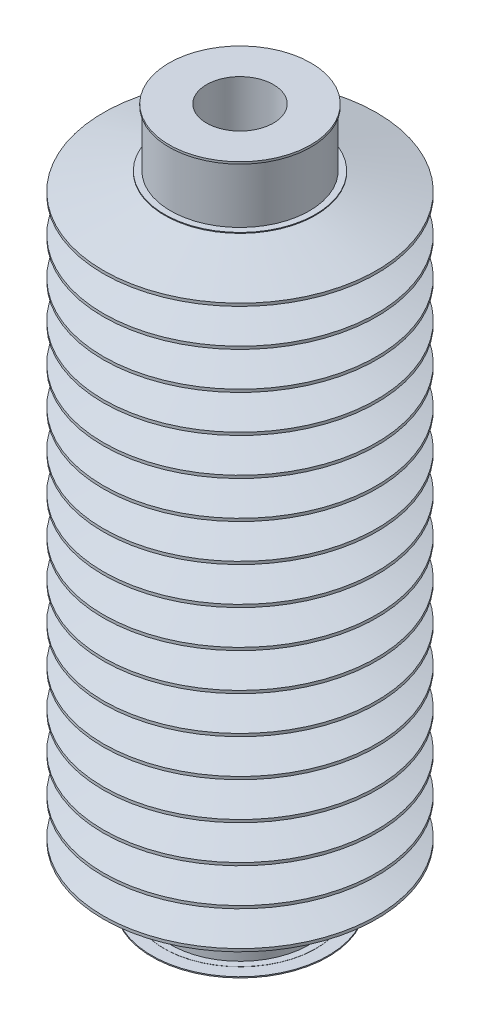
ISO-10303-21;
HEADER;
FILE_DESCRIPTION(('STEP AP214'),'2;1');
FILE_NAME('part.step','',(''),(''),'','','');
FILE_SCHEMA(('AUTOMOTIVE_DESIGN { 1 0 10303 214 1 1 1 1 }'));
ENDSEC;
DATA;
#1=APPLICATION_CONTEXT('core data for automotive mechanical design processes');
#2=APPLICATION_PROTOCOL_DEFINITION('international standard','automotive_design',2000,#1);
#3=PRODUCT_CONTEXT('',#1,'mechanical');
#4=PRODUCT('Part','Part','',(#3));
#5=PRODUCT_RELATED_PRODUCT_CATEGORY('part','',(#4));
#6=PRODUCT_DEFINITION_FORMATION('','',#4);
#7=PRODUCT_DEFINITION_CONTEXT('part definition',#1,'design');
#8=PRODUCT_DEFINITION('design','',#6,#7);
#9=PRODUCT_DEFINITION_SHAPE('','',#8);
#10=(LENGTH_UNIT() NAMED_UNIT(*) SI_UNIT(.MILLI.,.METRE.));
#11=(NAMED_UNIT(*) PLANE_ANGLE_UNIT() SI_UNIT($,.RADIAN.));
#12=(NAMED_UNIT(*) SI_UNIT($,.STERADIAN.) SOLID_ANGLE_UNIT());
#13=UNCERTAINTY_MEASURE_WITH_UNIT(LENGTH_MEASURE(1.E-05),#10,'distance_accuracy_value','');
#14=(GEOMETRIC_REPRESENTATION_CONTEXT(3) GLOBAL_UNCERTAINTY_ASSIGNED_CONTEXT((#13)) GLOBAL_UNIT_ASSIGNED_CONTEXT((#10,
#11,#12)) REPRESENTATION_CONTEXT('',''));
#15=CARTESIAN_POINT('',(0.,0.,0.));
#16=DIRECTION('',(0.,0.,1.));
#17=DIRECTION('',(1.,0.,0.));
#18=AXIS2_PLACEMENT_3D('',#15,#16,#17);
#19=CARTESIAN_POINT('',(25.,0.,0.));
#20=DIRECTION('',(0.,1.,0.));
#21=DIRECTION('',(1.,0.,0.));
#22=AXIS2_PLACEMENT_3D('',#19,#20,#21);
#23=PLANE('',#22);
#24=CARTESIAN_POINT('',(0.,0.,0.));
#25=DIRECTION('',(0.,-1.,0.));
#26=DIRECTION('',(0.,0.,-1.));
#27=AXIS2_PLACEMENT_3D('',#24,#25,#26);
#28=CIRCLE('',#27,25.);
#29=CARTESIAN_POINT('',(0.,0.,-25.));
#30=VERTEX_POINT('',#29);
#31=EDGE_CURVE('E11',#30,#30,#28,.T.);
#32=ORIENTED_EDGE('',*,*,#31,.T.);
#33=EDGE_LOOP('',(#32));
#34=FACE_BOUND('',#33,.T.);
#35=CARTESIAN_POINT('',(0.,0.,0.));
#36=DIRECTION('',(0.,-1.,0.));
#37=DIRECTION('',(0.,0.,-1.));
#38=AXIS2_PLACEMENT_3D('',#35,#36,#37);
#39=CIRCLE('',#38,11.);
#40=CARTESIAN_POINT('',(0.,0.,-11.));
#41=VERTEX_POINT('',#40);
#42=EDGE_CURVE('E368',#41,#41,#39,.T.);
#43=ORIENTED_EDGE('',*,*,#42,.F.);
#44=EDGE_LOOP('',(#43));
#45=FACE_BOUND('',#44,.T.);
#46=ADVANCED_FACE('F16',(#34,#45),#23,.F.);
#47=CARTESIAN_POINT('',(0.,0.,0.));
#48=DIRECTION('',(0.,1.,0.));
#49=DIRECTION('',(0.,0.,-1.));
#50=AXIS2_PLACEMENT_3D('',#47,#48,#49);
#51=CYLINDRICAL_SURFACE('',#50,25.);
#52=CARTESIAN_POINT('',(0.,0.3,0.));
#53=DIRECTION('',(0.,-1.,0.));
#54=DIRECTION('',(0.,0.,-1.));
#55=AXIS2_PLACEMENT_3D('',#52,#53,#54);
#56=CIRCLE('',#55,25.);
#57=CARTESIAN_POINT('',(0.,0.3,-25.));
#58=VERTEX_POINT('',#57);
#59=EDGE_CURVE('E27',#58,#58,#56,.T.);
#60=ORIENTED_EDGE('',*,*,#59,.T.);
#61=EDGE_LOOP('',(#60));
#62=FACE_BOUND('',#61,.T.);
#63=ORIENTED_EDGE('',*,*,#31,.F.);
#64=EDGE_LOOP('',(#63));
#65=FACE_BOUND('',#64,.T.);
#66=ADVANCED_FACE('F18',(#62,#65),#51,.T.);
#67=CARTESIAN_POINT('',(29.,0.3,0.));
#68=DIRECTION('',(0.,1.,0.));
#69=DIRECTION('',(1.,0.,0.));
#70=AXIS2_PLACEMENT_3D('',#67,#68,#69);
#71=PLANE('',#70);
#72=CARTESIAN_POINT('',(0.,0.3,0.));
#73=DIRECTION('',(0.,-1.,0.));
#74=DIRECTION('',(0.,0.,-1.));
#75=AXIS2_PLACEMENT_3D('',#72,#73,#74);
#76=CIRCLE('',#75,29.);
#77=CARTESIAN_POINT('',(0.,0.3,-29.));
#78=VERTEX_POINT('',#77);
#79=EDGE_CURVE('E351',#78,#78,#76,.T.);
#80=ORIENTED_EDGE('',*,*,#79,.T.);
#81=EDGE_LOOP('',(#80));
#82=FACE_BOUND('',#81,.T.);
#83=ORIENTED_EDGE('',*,*,#59,.F.);
#84=EDGE_LOOP('',(#83));
#85=FACE_BOUND('',#84,.T.);
#86=ADVANCED_FACE('F549',(#82,#85),#71,.F.);
#87=CARTESIAN_POINT('',(0.,0.,0.));
#88=DIRECTION('',(0.,1.,0.));
#89=DIRECTION('',(0.,0.,-1.));
#90=AXIS2_PLACEMENT_3D('',#87,#88,#89);
#91=CYLINDRICAL_SURFACE('',#90,29.);
#92=CARTESIAN_POINT('',(0.,0.65,0.));
#93=DIRECTION('',(0.,-1.,0.));
#94=DIRECTION('',(0.,0.,-1.));
#95=AXIS2_PLACEMENT_3D('',#92,#93,#94);
#96=CIRCLE('',#95,29.);
#97=CARTESIAN_POINT('',(0.,0.65,-29.));
#98=VERTEX_POINT('',#97);
#99=EDGE_CURVE('E444',#98,#98,#96,.T.);
#100=ORIENTED_EDGE('',*,*,#99,.T.);
#101=EDGE_LOOP('',(#100));
#102=FACE_BOUND('',#101,.T.);
#103=ORIENTED_EDGE('',*,*,#79,.F.);
#104=EDGE_LOOP('',(#103));
#105=FACE_BOUND('',#104,.T.);
#106=ADVANCED_FACE('F584',(#102,#105),#91,.T.);
#107=CARTESIAN_POINT('',(25.,0.65,0.));
#108=DIRECTION('',(0.,-1.,0.));
#109=DIRECTION('',(0.,0.,-1.));
#110=AXIS2_PLACEMENT_3D('',#107,#108,#109);
#111=PLANE('',#110);
#112=ORIENTED_EDGE('',*,*,#99,.F.);
#113=EDGE_LOOP('',(#112));
#114=FACE_BOUND('',#113,.T.);
#115=CARTESIAN_POINT('',(0.,0.65,0.));
#116=DIRECTION('',(0.,-1.,0.));
#117=DIRECTION('',(0.,0.,-1.));
#118=AXIS2_PLACEMENT_3D('',#115,#116,#117);
#119=CIRCLE('',#118,25.);
#120=CARTESIAN_POINT('',(0.,0.65,-25.));
#121=VERTEX_POINT('',#120);
#122=EDGE_CURVE('E20',#121,#121,#119,.T.);
#123=ORIENTED_EDGE('',*,*,#122,.T.);
#124=EDGE_LOOP('',(#123));
#125=FACE_BOUND('',#124,.T.);
#126=ADVANCED_FACE('F570',(#114,#125),#111,.F.);
#127=CARTESIAN_POINT('',(0.,0.,0.));
#128=DIRECTION('',(0.,1.,0.));
#129=DIRECTION('',(0.,0.,-1.));
#130=AXIS2_PLACEMENT_3D('',#127,#128,#129);
#131=CYLINDRICAL_SURFACE('',#130,25.);
#132=CARTESIAN_POINT('',(0.,0.7,0.));
#133=DIRECTION('',(0.,-1.,0.));
#134=DIRECTION('',(0.,0.,-1.));
#135=AXIS2_PLACEMENT_3D('',#132,#133,#134);
#136=CIRCLE('',#135,25.);
#137=CARTESIAN_POINT('',(0.,0.7,-25.));
#138=VERTEX_POINT('',#137);
#139=EDGE_CURVE('E374',#138,#138,#136,.T.);
#140=ORIENTED_EDGE('',*,*,#139,.T.);
#141=EDGE_LOOP('',(#140));
#142=FACE_BOUND('',#141,.T.);
#143=ORIENTED_EDGE('',*,*,#122,.F.);
#144=EDGE_LOOP('',(#143));
#145=FACE_BOUND('',#144,.T.);
#146=ADVANCED_FACE('F566',(#142,#145),#131,.T.);
#147=CARTESIAN_POINT('',(22.85,0.7,0.));
#148=DIRECTION('',(0.,-1.,0.));
#149=DIRECTION('',(0.,0.,-1.));
#150=AXIS2_PLACEMENT_3D('',#147,#148,#149);
#151=PLANE('',#150);
#152=ORIENTED_EDGE('',*,*,#139,.F.);
#153=EDGE_LOOP('',(#152));
#154=FACE_BOUND('',#153,.T.);
#155=CARTESIAN_POINT('',(0.,0.7,0.));
#156=DIRECTION('',(0.,-1.,0.));
#157=DIRECTION('',(0.,0.,-1.));
#158=AXIS2_PLACEMENT_3D('',#155,#156,#157);
#159=CIRCLE('',#158,22.85);
#160=CARTESIAN_POINT('',(0.,0.7,-22.85));
#161=VERTEX_POINT('',#160);
#162=EDGE_CURVE('E370',#161,#161,#159,.T.);
#163=ORIENTED_EDGE('',*,*,#162,.T.);
#164=EDGE_LOOP('',(#163));
#165=FACE_BOUND('',#164,.T.);
#166=ADVANCED_FACE('F562',(#154,#165),#151,.F.);
#167=CARTESIAN_POINT('',(0.,0.,0.));
#168=DIRECTION('',(0.,1.,0.));
#169=DIRECTION('',(0.,0.,-1.));
#170=AXIS2_PLACEMENT_3D('',#167,#168,#169);
#171=CYLINDRICAL_SURFACE('',#170,22.85);
#172=CARTESIAN_POINT('',(0.,12.95,0.));
#173=DIRECTION('',(0.,-1.,0.));
#174=DIRECTION('',(0.,0.,-1.));
#175=AXIS2_PLACEMENT_3D('',#172,#173,#174);
#176=CIRCLE('',#175,22.85);
#177=CARTESIAN_POINT('',(0.,12.95,-22.85));
#178=VERTEX_POINT('',#177);
#179=EDGE_CURVE('E288',#178,#178,#176,.T.);
#180=ORIENTED_EDGE('',*,*,#179,.T.);
#181=EDGE_LOOP('',(#180));
#182=FACE_BOUND('',#181,.T.);
#183=ORIENTED_EDGE('',*,*,#162,.F.);
#184=EDGE_LOOP('',(#183));
#185=FACE_BOUND('',#184,.T.);
#186=ADVANCED_FACE('F565',(#182,#185),#171,.T.);
#187=CARTESIAN_POINT('',(24.85,12.95,0.));
#188=DIRECTION('',(0.,1.,0.));
#189=DIRECTION('',(1.,0.,0.));
#190=AXIS2_PLACEMENT_3D('',#187,#188,#189);
#191=PLANE('',#190);
#192=CARTESIAN_POINT('',(0.,12.95,0.));
#193=DIRECTION('',(0.,-1.,0.));
#194=DIRECTION('',(0.,0.,-1.));
#195=AXIS2_PLACEMENT_3D('',#192,#193,#194);
#196=CIRCLE('',#195,24.85);
#197=CARTESIAN_POINT('',(0.,12.95,-24.85));
#198=VERTEX_POINT('',#197);
#199=EDGE_CURVE('E483',#198,#198,#196,.T.);
#200=ORIENTED_EDGE('',*,*,#199,.T.);
#201=EDGE_LOOP('',(#200));
#202=FACE_BOUND('',#201,.T.);
#203=ORIENTED_EDGE('',*,*,#179,.F.);
#204=EDGE_LOOP('',(#203));
#205=FACE_BOUND('',#204,.T.);
#206=ADVANCED_FACE('F637',(#202,#205),#191,.F.);
#207=CARTESIAN_POINT('',(0.,0.,0.));
#208=DIRECTION('',(0.,1.,0.));
#209=DIRECTION('',(0.,0.,-1.));
#210=AXIS2_PLACEMENT_3D('',#207,#208,#209);
#211=CYLINDRICAL_SURFACE('',#210,24.85);
#212=CARTESIAN_POINT('',(0.,13.4339,0.));
#213=DIRECTION('',(0.,-1.,0.));
#214=DIRECTION('',(0.,0.,-1.));
#215=AXIS2_PLACEMENT_3D('',#212,#213,#214);
#216=CIRCLE('',#215,24.85);
#217=CARTESIAN_POINT('',(0.,13.4339,-24.85));
#218=VERTEX_POINT('',#217);
#219=EDGE_CURVE('E293',#218,#218,#216,.T.);
#220=ORIENTED_EDGE('',*,*,#219,.T.);
#221=EDGE_LOOP('',(#220));
#222=FACE_BOUND('',#221,.T.);
#223=ORIENTED_EDGE('',*,*,#199,.F.);
#224=EDGE_LOOP('',(#223));
#225=FACE_BOUND('',#224,.T.);
#226=ADVANCED_FACE('F748',(#222,#225),#211,.T.);
#227=CARTESIAN_POINT('',(0.,19.0682221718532,0.));
#228=DIRECTION('',(0.,1.,0.));
#229=DIRECTION('',(0.,0.,1.));
#230=AXIS2_PLACEMENT_3D('',#227,#228,#229);
#231=CONICAL_SURFACE('',#230,45.,1.298140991);
#232=CARTESIAN_POINT('',(0.,19.0682221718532,0.));
#233=DIRECTION('',(0.,-1.,0.));
#234=DIRECTION('',(0.,0.,-1.));
#235=AXIS2_PLACEMENT_3D('',#232,#233,#234);
#236=CIRCLE('',#235,45.);
#237=CARTESIAN_POINT('',(0.,19.0682221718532,-45.));
#238=VERTEX_POINT('',#237);
#239=EDGE_CURVE('E290',#238,#238,#236,.T.);
#240=ORIENTED_EDGE('',*,*,#239,.T.);
#241=EDGE_LOOP('',(#240));
#242=FACE_BOUND('',#241,.T.);
#243=ORIENTED_EDGE('',*,*,#219,.F.);
#244=EDGE_LOOP('',(#243));
#245=FACE_BOUND('',#244,.T.);
#246=ADVANCED_FACE('F554',(#242,#245),#231,.T.);
#247=CARTESIAN_POINT('',(0.,13.4339,0.));
#248=DIRECTION('',(0.,1.,0.));
#249=DIRECTION('',(0.,0.,-1.));
#250=AXIS2_PLACEMENT_3D('',#247,#248,#249);
#251=CYLINDRICAL_SURFACE('',#250,45.);
#252=CARTESIAN_POINT('',(0.,19.99939,0.));
#253=DIRECTION('',(0.,-1.,0.));
#254=DIRECTION('',(0.,0.,-1.));
#255=AXIS2_PLACEMENT_3D('',#252,#253,#254);
#256=CIRCLE('',#255,45.);
#257=CARTESIAN_POINT('',(0.,19.99939,-45.));
#258=VERTEX_POINT('',#257);
#259=EDGE_CURVE('E294',#258,#258,#256,.T.);
#260=ORIENTED_EDGE('',*,*,#259,.T.);
#261=EDGE_LOOP('',(#260));
#262=FACE_BOUND('',#261,.T.);
#263=ORIENTED_EDGE('',*,*,#239,.F.);
#264=EDGE_LOOP('',(#263));
#265=FACE_BOUND('',#264,.T.);
#266=ADVANCED_FACE('F653',(#262,#265),#251,.T.);
#267=CARTESIAN_POINT('',(0.,25.6337648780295,0.));
#268=DIRECTION('',(0.,-1.,0.));
#269=DIRECTION('',(0.,0.,-1.));
#270=AXIS2_PLACEMENT_3D('',#267,#268,#269);
#271=CONICAL_SURFACE('',#270,24.85,1.298138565);
#272=ORIENTED_EDGE('',*,*,#259,.F.);
#273=EDGE_LOOP('',(#272));
#274=FACE_BOUND('',#273,.T.);
#275=CARTESIAN_POINT('',(0.,25.6337648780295,0.));
#276=DIRECTION('',(0.,-1.,0.));
#277=DIRECTION('',(0.,0.,-1.));
#278=AXIS2_PLACEMENT_3D('',#275,#276,#277);
#279=CIRCLE('',#278,24.85);
#280=CARTESIAN_POINT('',(0.,25.6337648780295,-24.85));
#281=VERTEX_POINT('',#280);
#282=EDGE_CURVE('E445',#281,#281,#279,.T.);
#283=ORIENTED_EDGE('',*,*,#282,.T.);
#284=EDGE_LOOP('',(#283));
#285=FACE_BOUND('',#284,.T.);
#286=ADVANCED_FACE('F643',(#274,#285),#271,.T.);
#287=CARTESIAN_POINT('',(0.,13.4339,0.));
#288=DIRECTION('',(0.,1.,0.));
#289=DIRECTION('',(0.,0.,-1.));
#290=AXIS2_PLACEMENT_3D('',#287,#288,#289);
#291=CYLINDRICAL_SURFACE('',#290,24.85);
#292=CARTESIAN_POINT('',(0.,25.70265,0.));
#293=DIRECTION('',(0.,-1.,0.));
#294=DIRECTION('',(0.,0.,-1.));
#295=AXIS2_PLACEMENT_3D('',#292,#293,#294);
#296=CIRCLE('',#295,24.85);
#297=CARTESIAN_POINT('',(0.,25.70265,-24.85));
#298=VERTEX_POINT('',#297);
#299=EDGE_CURVE('E449',#298,#298,#296,.T.);
#300=ORIENTED_EDGE('',*,*,#299,.T.);
#301=EDGE_LOOP('',(#300));
#302=FACE_BOUND('',#301,.T.);
#303=ORIENTED_EDGE('',*,*,#282,.F.);
#304=EDGE_LOOP('',(#303));
#305=FACE_BOUND('',#304,.T.);
#306=ADVANCED_FACE('F639',(#302,#305),#291,.T.);
#307=CARTESIAN_POINT('',(0.,31.3369721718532,0.));
#308=DIRECTION('',(0.,1.,0.));
#309=DIRECTION('',(0.,0.,1.));
#310=AXIS2_PLACEMENT_3D('',#307,#308,#309);
#311=CONICAL_SURFACE('',#310,45.,1.298140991);
#312=CARTESIAN_POINT('',(0.,31.3369721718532,0.));
#313=DIRECTION('',(0.,-1.,0.));
#314=DIRECTION('',(0.,0.,-1.));
#315=AXIS2_PLACEMENT_3D('',#312,#313,#314);
#316=CIRCLE('',#315,45.);
#317=CARTESIAN_POINT('',(0.,31.3369721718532,-45.));
#318=VERTEX_POINT('',#317);
#319=EDGE_CURVE('E435',#318,#318,#316,.T.);
#320=ORIENTED_EDGE('',*,*,#319,.T.);
#321=EDGE_LOOP('',(#320));
#322=FACE_BOUND('',#321,.T.);
#323=ORIENTED_EDGE('',*,*,#299,.F.);
#324=EDGE_LOOP('',(#323));
#325=FACE_BOUND('',#324,.T.);
#326=ADVANCED_FACE('F642',(#322,#325),#311,.T.);
#327=CARTESIAN_POINT('',(0.,13.4339,0.));
#328=DIRECTION('',(0.,1.,0.));
#329=DIRECTION('',(0.,0.,-1.));
#330=AXIS2_PLACEMENT_3D('',#327,#328,#329);
#331=CYLINDRICAL_SURFACE('',#330,45.);
#332=CARTESIAN_POINT('',(0.,32.26814,0.));
#333=DIRECTION('',(0.,-1.,0.));
#334=DIRECTION('',(0.,0.,-1.));
#335=AXIS2_PLACEMENT_3D('',#332,#333,#334);
#336=CIRCLE('',#335,45.);
#337=CARTESIAN_POINT('',(0.,32.26814,-45.));
#338=VERTEX_POINT('',#337);
#339=EDGE_CURVE('E431',#338,#338,#336,.T.);
#340=ORIENTED_EDGE('',*,*,#339,.T.);
#341=EDGE_LOOP('',(#340));
#342=FACE_BOUND('',#341,.T.);
#343=ORIENTED_EDGE('',*,*,#319,.F.);
#344=EDGE_LOOP('',(#343));
#345=FACE_BOUND('',#344,.T.);
#346=ADVANCED_FACE('F597',(#342,#345),#331,.T.);
#347=CARTESIAN_POINT('',(0.,37.9025148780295,0.));
#348=DIRECTION('',(0.,-1.,0.));
#349=DIRECTION('',(0.,0.,-1.));
#350=AXIS2_PLACEMENT_3D('',#347,#348,#349);
#351=CONICAL_SURFACE('',#350,24.85,1.298138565);
#352=ORIENTED_EDGE('',*,*,#339,.F.);
#353=EDGE_LOOP('',(#352));
#354=FACE_BOUND('',#353,.T.);
#355=CARTESIAN_POINT('',(0.,37.9025148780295,0.));
#356=DIRECTION('',(0.,-1.,0.));
#357=DIRECTION('',(0.,0.,-1.));
#358=AXIS2_PLACEMENT_3D('',#355,#356,#357);
#359=CIRCLE('',#358,24.85);
#360=CARTESIAN_POINT('',(0.,37.9025148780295,-24.85));
#361=VERTEX_POINT('',#360);
#362=EDGE_CURVE('E436',#361,#361,#359,.T.);
#363=ORIENTED_EDGE('',*,*,#362,.T.);
#364=EDGE_LOOP('',(#363));
#365=FACE_BOUND('',#364,.T.);
#366=ADVANCED_FACE('F593',(#354,#365),#351,.T.);
#367=CARTESIAN_POINT('',(0.,13.4339,0.));
#368=DIRECTION('',(0.,1.,0.));
#369=DIRECTION('',(0.,0.,-1.));
#370=AXIS2_PLACEMENT_3D('',#367,#368,#369);
#371=CYLINDRICAL_SURFACE('',#370,24.85);
#372=CARTESIAN_POINT('',(0.,37.9714,0.));
#373=DIRECTION('',(0.,-1.,0.));
#374=DIRECTION('',(0.,0.,-1.));
#375=AXIS2_PLACEMENT_3D('',#372,#373,#374);
#376=CIRCLE('',#375,24.85);
#377=CARTESIAN_POINT('',(0.,37.9714,-24.85));
#378=VERTEX_POINT('',#377);
#379=EDGE_CURVE('E453',#378,#378,#376,.T.);
#380=ORIENTED_EDGE('',*,*,#379,.T.);
#381=EDGE_LOOP('',(#380));
#382=FACE_BOUND('',#381,.T.);
#383=ORIENTED_EDGE('',*,*,#362,.F.);
#384=EDGE_LOOP('',(#383));
#385=FACE_BOUND('',#384,.T.);
#386=ADVANCED_FACE('F596',(#382,#385),#371,.T.);
#387=CARTESIAN_POINT('',(0.,43.6057221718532,0.));
#388=DIRECTION('',(0.,1.,0.));
#389=DIRECTION('',(0.,0.,1.));
#390=AXIS2_PLACEMENT_3D('',#387,#388,#389);
#391=CONICAL_SURFACE('',#390,45.,1.298140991);
#392=CARTESIAN_POINT('',(0.,43.6057221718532,0.));
#393=DIRECTION('',(0.,-1.,0.));
#394=DIRECTION('',(0.,0.,-1.));
#395=AXIS2_PLACEMENT_3D('',#392,#393,#394);
#396=CIRCLE('',#395,45.);
#397=CARTESIAN_POINT('',(0.,43.6057221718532,-45.));
#398=VERTEX_POINT('',#397);
#399=EDGE_CURVE('E458',#398,#398,#396,.T.);
#400=ORIENTED_EDGE('',*,*,#399,.T.);
#401=EDGE_LOOP('',(#400));
#402=FACE_BOUND('',#401,.T.);
#403=ORIENTED_EDGE('',*,*,#379,.F.);
#404=EDGE_LOOP('',(#403));
#405=FACE_BOUND('',#404,.T.);
#406=ADVANCED_FACE('F658',(#402,#405),#391,.T.);
#407=CARTESIAN_POINT('',(0.,13.4339,0.));
#408=DIRECTION('',(0.,1.,0.));
#409=DIRECTION('',(0.,0.,-1.));
#410=AXIS2_PLACEMENT_3D('',#407,#408,#409);
#411=CYLINDRICAL_SURFACE('',#410,45.);
#412=CARTESIAN_POINT('',(0.,44.53689,0.));
#413=DIRECTION('',(0.,-1.,0.));
#414=DIRECTION('',(0.,0.,-1.));
#415=AXIS2_PLACEMENT_3D('',#412,#413,#414);
#416=CIRCLE('',#415,45.);
#417=CARTESIAN_POINT('',(0.,44.53689,-45.));
#418=VERTEX_POINT('',#417);
#419=EDGE_CURVE('E454',#418,#418,#416,.T.);
#420=ORIENTED_EDGE('',*,*,#419,.T.);
#421=EDGE_LOOP('',(#420));
#422=FACE_BOUND('',#421,.T.);
#423=ORIENTED_EDGE('',*,*,#399,.F.);
#424=EDGE_LOOP('',(#423));
#425=FACE_BOUND('',#424,.T.);
#426=ADVANCED_FACE('F1164',(#422,#425),#411,.T.);
#427=CARTESIAN_POINT('',(0.,50.1712648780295,0.));
#428=DIRECTION('',(0.,-1.,0.));
#429=DIRECTION('',(0.,0.,-1.));
#430=AXIS2_PLACEMENT_3D('',#427,#428,#429);
#431=CONICAL_SURFACE('',#430,24.85,1.298138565);
#432=ORIENTED_EDGE('',*,*,#419,.F.);
#433=EDGE_LOOP('',(#432));
#434=FACE_BOUND('',#433,.T.);
#435=CARTESIAN_POINT('',(0.,50.1712648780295,0.));
#436=DIRECTION('',(0.,-1.,0.));
#437=DIRECTION('',(0.,0.,-1.));
#438=AXIS2_PLACEMENT_3D('',#435,#436,#437);
#439=CIRCLE('',#438,24.85);
#440=CARTESIAN_POINT('',(0.,50.1712648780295,-24.85));
#441=VERTEX_POINT('',#440);
#442=EDGE_CURVE('E340',#441,#441,#439,.T.);
#443=ORIENTED_EDGE('',*,*,#442,.T.);
#444=EDGE_LOOP('',(#443));
#445=FACE_BOUND('',#444,.T.);
#446=ADVANCED_FACE('F808',(#434,#445),#431,.T.);
#447=CARTESIAN_POINT('',(0.,13.4339,0.));
#448=DIRECTION('',(0.,1.,0.));
#449=DIRECTION('',(0.,0.,-1.));
#450=AXIS2_PLACEMENT_3D('',#447,#448,#449);
#451=CYLINDRICAL_SURFACE('',#450,24.85);
#452=CARTESIAN_POINT('',(0.,50.24015,0.));
#453=DIRECTION('',(0.,-1.,0.));
#454=DIRECTION('',(0.,0.,-1.));
#455=AXIS2_PLACEMENT_3D('',#452,#453,#454);
#456=CIRCLE('',#455,24.85);
#457=CARTESIAN_POINT('',(0.,50.24015,-24.85));
#458=VERTEX_POINT('',#457);
#459=EDGE_CURVE('E336',#458,#458,#456,.T.);
#460=ORIENTED_EDGE('',*,*,#459,.T.);
#461=EDGE_LOOP('',(#460));
#462=FACE_BOUND('',#461,.T.);
#463=ORIENTED_EDGE('',*,*,#442,.F.);
#464=EDGE_LOOP('',(#463));
#465=FACE_BOUND('',#464,.T.);
#466=ADVANCED_FACE('F582',(#462,#465),#451,.T.);
#467=CARTESIAN_POINT('',(0.,55.8744721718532,0.));
#468=DIRECTION('',(0.,1.,0.));
#469=DIRECTION('',(0.,0.,1.));
#470=AXIS2_PLACEMENT_3D('',#467,#468,#469);
#471=CONICAL_SURFACE('',#470,45.,1.298140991);
#472=CARTESIAN_POINT('',(0.,55.8744721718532,0.));
#473=DIRECTION('',(0.,-1.,0.));
#474=DIRECTION('',(0.,0.,-1.));
#475=AXIS2_PLACEMENT_3D('',#472,#473,#474);
#476=CIRCLE('',#475,45.);
#477=CARTESIAN_POINT('',(0.,55.8744721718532,-45.));
#478=VERTEX_POINT('',#477);
#479=EDGE_CURVE('E341',#478,#478,#476,.T.);
#480=ORIENTED_EDGE('',*,*,#479,.T.);
#481=EDGE_LOOP('',(#480));
#482=FACE_BOUND('',#481,.T.);
#483=ORIENTED_EDGE('',*,*,#459,.F.);
#484=EDGE_LOOP('',(#483));
#485=FACE_BOUND('',#484,.T.);
#486=ADVANCED_FACE('F578',(#482,#485),#471,.T.);
#487=CARTESIAN_POINT('',(0.,13.4339,0.));
#488=DIRECTION('',(0.,1.,0.));
#489=DIRECTION('',(0.,0.,-1.));
#490=AXIS2_PLACEMENT_3D('',#487,#488,#489);
#491=CYLINDRICAL_SURFACE('',#490,45.);
#492=CARTESIAN_POINT('',(0.,56.80564,0.));
#493=DIRECTION('',(0.,-1.,0.));
#494=DIRECTION('',(0.,0.,-1.));
#495=AXIS2_PLACEMENT_3D('',#492,#493,#494);
#496=CIRCLE('',#495,45.);
#497=CARTESIAN_POINT('',(0.,56.80564,-45.));
#498=VERTEX_POINT('',#497);
#499=EDGE_CURVE('E378',#498,#498,#496,.T.);
#500=ORIENTED_EDGE('',*,*,#499,.T.);
#501=EDGE_LOOP('',(#500));
#502=FACE_BOUND('',#501,.T.);
#503=ORIENTED_EDGE('',*,*,#479,.F.);
#504=EDGE_LOOP('',(#503));
#505=FACE_BOUND('',#504,.T.);
#506=ADVANCED_FACE('F581',(#502,#505),#491,.T.);
#507=CARTESIAN_POINT('',(0.,62.4400148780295,0.));
#508=DIRECTION('',(0.,-1.,0.));
#509=DIRECTION('',(0.,0.,-1.));
#510=AXIS2_PLACEMENT_3D('',#507,#508,#509);
#511=CONICAL_SURFACE('',#510,24.85,1.298138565);
#512=ORIENTED_EDGE('',*,*,#499,.F.);
#513=EDGE_LOOP('',(#512));
#514=FACE_BOUND('',#513,.T.);
#515=CARTESIAN_POINT('',(0.,62.4400148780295,0.));
#516=DIRECTION('',(0.,-1.,0.));
#517=DIRECTION('',(0.,0.,-1.));
#518=AXIS2_PLACEMENT_3D('',#515,#516,#517);
#519=CIRCLE('',#518,24.85);
#520=CARTESIAN_POINT('',(0.,62.4400148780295,-24.85));
#521=VERTEX_POINT('',#520);
#522=EDGE_CURVE('E393',#521,#521,#519,.T.);
#523=ORIENTED_EDGE('',*,*,#522,.T.);
#524=EDGE_LOOP('',(#523));
#525=FACE_BOUND('',#524,.T.);
#526=ADVANCED_FACE('F627',(#514,#525),#511,.T.);
#527=CARTESIAN_POINT('',(0.,13.4339,0.));
#528=DIRECTION('',(0.,1.,0.));
#529=DIRECTION('',(0.,0.,-1.));
#530=AXIS2_PLACEMENT_3D('',#527,#528,#529);
#531=CYLINDRICAL_SURFACE('',#530,24.85);
#532=CARTESIAN_POINT('',(0.,62.5089,0.));
#533=DIRECTION('',(0.,-1.,0.));
#534=DIRECTION('',(0.,0.,-1.));
#535=AXIS2_PLACEMENT_3D('',#532,#533,#534);
#536=CIRCLE('',#535,24.85);
#537=CARTESIAN_POINT('',(0.,62.5089,-24.85));
#538=VERTEX_POINT('',#537);
#539=EDGE_CURVE('E462',#538,#538,#536,.T.);
#540=ORIENTED_EDGE('',*,*,#539,.T.);
#541=EDGE_LOOP('',(#540));
#542=FACE_BOUND('',#541,.T.);
#543=ORIENTED_EDGE('',*,*,#522,.F.);
#544=EDGE_LOOP('',(#543));
#545=FACE_BOUND('',#544,.T.);
#546=ADVANCED_FACE('F630',(#542,#545),#531,.T.);
#547=CARTESIAN_POINT('',(0.,68.1432221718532,0.));
#548=DIRECTION('',(0.,1.,0.));
#549=DIRECTION('',(0.,0.,1.));
#550=AXIS2_PLACEMENT_3D('',#547,#548,#549);
#551=CONICAL_SURFACE('',#550,45.,1.298140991);
#552=CARTESIAN_POINT('',(0.,68.1432221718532,0.));
#553=DIRECTION('',(0.,-1.,0.));
#554=DIRECTION('',(0.,0.,-1.));
#555=AXIS2_PLACEMENT_3D('',#552,#553,#554);
#556=CIRCLE('',#555,45.);
#557=CARTESIAN_POINT('',(0.,68.1432221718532,-45.));
#558=VERTEX_POINT('',#557);
#559=EDGE_CURVE('E334',#558,#558,#556,.T.);
#560=ORIENTED_EDGE('',*,*,#559,.T.);
#561=EDGE_LOOP('',(#560));
#562=FACE_BOUND('',#561,.T.);
#563=ORIENTED_EDGE('',*,*,#539,.F.);
#564=EDGE_LOOP('',(#563));
#565=FACE_BOUND('',#564,.T.);
#566=ADVANCED_FACE('F979',(#562,#565),#551,.T.);
#567=CARTESIAN_POINT('',(0.,13.4339,0.));
#568=DIRECTION('',(0.,1.,0.));
#569=DIRECTION('',(0.,0.,-1.));
#570=AXIS2_PLACEMENT_3D('',#567,#568,#569);
#571=CYLINDRICAL_SURFACE('',#570,45.);
#572=CARTESIAN_POINT('',(0.,69.07439,0.));
#573=DIRECTION('',(0.,-1.,0.));
#574=DIRECTION('',(0.,0.,-1.));
#575=AXIS2_PLACEMENT_3D('',#572,#573,#574);
#576=CIRCLE('',#575,45.);
#577=CARTESIAN_POINT('',(0.,69.07439,-45.));
#578=VERTEX_POINT('',#577);
#579=EDGE_CURVE('E330',#578,#578,#576,.T.);
#580=ORIENTED_EDGE('',*,*,#579,.T.);
#581=EDGE_LOOP('',(#580));
#582=FACE_BOUND('',#581,.T.);
#583=ORIENTED_EDGE('',*,*,#559,.F.);
#584=EDGE_LOOP('',(#583));
#585=FACE_BOUND('',#584,.T.);
#586=ADVANCED_FACE('F576',(#582,#585),#571,.T.);
#587=CARTESIAN_POINT('',(0.,74.7087648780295,0.));
#588=DIRECTION('',(0.,-1.,0.));
#589=DIRECTION('',(0.,0.,-1.));
#590=AXIS2_PLACEMENT_3D('',#587,#588,#589);
#591=CONICAL_SURFACE('',#590,24.85,1.298138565);
#592=ORIENTED_EDGE('',*,*,#579,.F.);
#593=EDGE_LOOP('',(#592));
#594=FACE_BOUND('',#593,.T.);
#595=CARTESIAN_POINT('',(0.,74.7087648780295,0.));
#596=DIRECTION('',(0.,-1.,0.));
#597=DIRECTION('',(0.,0.,-1.));
#598=AXIS2_PLACEMENT_3D('',#595,#596,#597);
#599=CIRCLE('',#598,24.85);
#600=CARTESIAN_POINT('',(0.,74.7087648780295,-24.85));
#601=VERTEX_POINT('',#600);
#602=EDGE_CURVE('E335',#601,#601,#599,.T.);
#603=ORIENTED_EDGE('',*,*,#602,.T.);
#604=EDGE_LOOP('',(#603));
#605=FACE_BOUND('',#604,.T.);
#606=ADVANCED_FACE('F572',(#594,#605),#591,.T.);
#607=CARTESIAN_POINT('',(0.,13.4339,0.));
#608=DIRECTION('',(0.,1.,0.));
#609=DIRECTION('',(0.,0.,-1.));
#610=AXIS2_PLACEMENT_3D('',#607,#608,#609);
#611=CYLINDRICAL_SURFACE('',#610,24.85);
#612=CARTESIAN_POINT('',(0.,74.77765,0.));
#613=DIRECTION('',(0.,-1.,0.));
#614=DIRECTION('',(0.,0.,-1.));
#615=AXIS2_PLACEMENT_3D('',#612,#613,#614);
#616=CIRCLE('',#615,24.85);
#617=CARTESIAN_POINT('',(0.,74.77765,-24.85));
#618=VERTEX_POINT('',#617);
#619=EDGE_CURVE('E346',#618,#618,#616,.T.);
#620=ORIENTED_EDGE('',*,*,#619,.T.);
#621=EDGE_LOOP('',(#620));
#622=FACE_BOUND('',#621,.T.);
#623=ORIENTED_EDGE('',*,*,#602,.F.);
#624=EDGE_LOOP('',(#623));
#625=FACE_BOUND('',#624,.T.);
#626=ADVANCED_FACE('F575',(#622,#625),#611,.T.);
#627=CARTESIAN_POINT('',(0.,80.4119721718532,0.));
#628=DIRECTION('',(0.,1.,0.));
#629=DIRECTION('',(0.,0.,1.));
#630=AXIS2_PLACEMENT_3D('',#627,#628,#629);
#631=CONICAL_SURFACE('',#630,45.,1.298140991);
#632=CARTESIAN_POINT('',(0.,80.4119721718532,0.));
#633=DIRECTION('',(0.,-1.,0.));
#634=DIRECTION('',(0.,0.,-1.));
#635=AXIS2_PLACEMENT_3D('',#632,#633,#634);
#636=CIRCLE('',#635,45.);
#637=CARTESIAN_POINT('',(0.,80.4119721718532,-45.));
#638=VERTEX_POINT('',#637);
#639=EDGE_CURVE('E342',#638,#638,#636,.T.);
#640=ORIENTED_EDGE('',*,*,#639,.T.);
#641=EDGE_LOOP('',(#640));
#642=FACE_BOUND('',#641,.T.);
#643=ORIENTED_EDGE('',*,*,#619,.F.);
#644=EDGE_LOOP('',(#643));
#645=FACE_BOUND('',#644,.T.);
#646=ADVANCED_FACE('F732',(#642,#645),#631,.T.);
#647=CARTESIAN_POINT('',(0.,13.4339,0.));
#648=DIRECTION('',(0.,1.,0.));
#649=DIRECTION('',(0.,0.,-1.));
#650=AXIS2_PLACEMENT_3D('',#647,#648,#649);
#651=CYLINDRICAL_SURFACE('',#650,45.);
#652=CARTESIAN_POINT('',(0.,81.34314,0.));
#653=DIRECTION('',(0.,-1.,0.));
#654=DIRECTION('',(0.,0.,-1.));
#655=AXIS2_PLACEMENT_3D('',#652,#653,#654);
#656=CIRCLE('',#655,45.);
#657=CARTESIAN_POINT('',(0.,81.34314,-45.));
#658=VERTEX_POINT('',#657);
#659=EDGE_CURVE('E347',#658,#658,#656,.T.);
#660=ORIENTED_EDGE('',*,*,#659,.T.);
#661=EDGE_LOOP('',(#660));
#662=FACE_BOUND('',#661,.T.);
#663=ORIENTED_EDGE('',*,*,#639,.F.);
#664=EDGE_LOOP('',(#663));
#665=FACE_BOUND('',#664,.T.);
#666=ADVANCED_FACE('F619',(#662,#665),#651,.T.);
#667=CARTESIAN_POINT('',(0.,86.9775148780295,0.));
#668=DIRECTION('',(0.,-1.,0.));
#669=DIRECTION('',(0.,0.,-1.));
#670=AXIS2_PLACEMENT_3D('',#667,#668,#669);
#671=CONICAL_SURFACE('',#670,24.85,1.298138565);
#672=ORIENTED_EDGE('',*,*,#659,.F.);
#673=EDGE_LOOP('',(#672));
#674=FACE_BOUND('',#673,.T.);
#675=CARTESIAN_POINT('',(0.,86.9775148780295,0.));
#676=DIRECTION('',(0.,-1.,0.));
#677=DIRECTION('',(0.,0.,-1.));
#678=AXIS2_PLACEMENT_3D('',#675,#676,#677);
#679=CIRCLE('',#678,24.85);
#680=CARTESIAN_POINT('',(0.,86.9775148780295,-24.85));
#681=VERTEX_POINT('',#680);
#682=EDGE_CURVE('E355',#681,#681,#679,.T.);
#683=ORIENTED_EDGE('',*,*,#682,.T.);
#684=EDGE_LOOP('',(#683));
#685=FACE_BOUND('',#684,.T.);
#686=ADVANCED_FACE('F615',(#674,#685),#671,.T.);
#687=CARTESIAN_POINT('',(0.,13.4339,0.));
#688=DIRECTION('',(0.,1.,0.));
#689=DIRECTION('',(0.,0.,-1.));
#690=AXIS2_PLACEMENT_3D('',#687,#688,#689);
#691=CYLINDRICAL_SURFACE('',#690,24.85);
#692=CARTESIAN_POINT('',(0.,87.0464,0.));
#693=DIRECTION('',(0.,-1.,0.));
#694=DIRECTION('',(0.,0.,-1.));
#695=AXIS2_PLACEMENT_3D('',#692,#693,#694);
#696=CIRCLE('',#695,24.85);
#697=CARTESIAN_POINT('',(0.,87.0464,-24.85));
#698=VERTEX_POINT('',#697);
#699=EDGE_CURVE('E362',#698,#698,#696,.T.);
#700=ORIENTED_EDGE('',*,*,#699,.T.);
#701=EDGE_LOOP('',(#700));
#702=FACE_BOUND('',#701,.T.);
#703=ORIENTED_EDGE('',*,*,#682,.F.);
#704=EDGE_LOOP('',(#703));
#705=FACE_BOUND('',#704,.T.);
#706=ADVANCED_FACE('F618',(#702,#705),#691,.T.);
#707=CARTESIAN_POINT('',(0.,92.6807221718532,0.));
#708=DIRECTION('',(0.,1.,0.));
#709=DIRECTION('',(0.,0.,1.));
#710=AXIS2_PLACEMENT_3D('',#707,#708,#709);
#711=CONICAL_SURFACE('',#710,45.,1.298140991);
#712=CARTESIAN_POINT('',(0.,92.6807221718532,0.));
#713=DIRECTION('',(0.,-1.,0.));
#714=DIRECTION('',(0.,0.,-1.));
#715=AXIS2_PLACEMENT_3D('',#712,#713,#714);
#716=CIRCLE('',#715,45.);
#717=CARTESIAN_POINT('',(0.,92.6807221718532,-45.));
#718=VERTEX_POINT('',#717);
#719=EDGE_CURVE('E440',#718,#718,#716,.T.);
#720=ORIENTED_EDGE('',*,*,#719,.T.);
#721=EDGE_LOOP('',(#720));
#722=FACE_BOUND('',#721,.T.);
#723=ORIENTED_EDGE('',*,*,#699,.F.);
#724=EDGE_LOOP('',(#723));
#725=FACE_BOUND('',#724,.T.);
#726=ADVANCED_FACE('F649',(#722,#725),#711,.T.);
#727=CARTESIAN_POINT('',(0.,13.4339,0.));
#728=DIRECTION('',(0.,1.,0.));
#729=DIRECTION('',(0.,0.,-1.));
#730=AXIS2_PLACEMENT_3D('',#727,#728,#729);
#731=CYLINDRICAL_SURFACE('',#730,45.);
#732=CARTESIAN_POINT('',(0.,93.61189,0.));
#733=DIRECTION('',(0.,-1.,0.));
#734=DIRECTION('',(0.,0.,-1.));
#735=AXIS2_PLACEMENT_3D('',#732,#733,#734);
#736=CIRCLE('',#735,45.);
#737=CARTESIAN_POINT('',(0.,93.61189,-45.));
#738=VERTEX_POINT('',#737);
#739=EDGE_CURVE('E496',#738,#738,#736,.T.);
#740=ORIENTED_EDGE('',*,*,#739,.T.);
#741=EDGE_LOOP('',(#740));
#742=FACE_BOUND('',#741,.T.);
#743=ORIENTED_EDGE('',*,*,#719,.F.);
#744=EDGE_LOOP('',(#743));
#745=FACE_BOUND('',#744,.T.);
#746=ADVANCED_FACE('F560',(#742,#745),#731,.T.);
#747=CARTESIAN_POINT('',(0.,99.2462648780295,0.));
#748=DIRECTION('',(0.,-1.,0.));
#749=DIRECTION('',(0.,0.,-1.));
#750=AXIS2_PLACEMENT_3D('',#747,#748,#749);
#751=CONICAL_SURFACE('',#750,24.85,1.298138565);
#752=ORIENTED_EDGE('',*,*,#739,.F.);
#753=EDGE_LOOP('',(#752));
#754=FACE_BOUND('',#753,.T.);
#755=CARTESIAN_POINT('',(0.,99.2462648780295,0.));
#756=DIRECTION('',(0.,-1.,0.));
#757=DIRECTION('',(0.,0.,-1.));
#758=AXIS2_PLACEMENT_3D('',#755,#756,#757);
#759=CIRCLE('',#758,24.85);
#760=CARTESIAN_POINT('',(0.,99.2462648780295,-24.85));
#761=VERTEX_POINT('',#760);
#762=EDGE_CURVE('E425',#761,#761,#759,.T.);
#763=ORIENTED_EDGE('',*,*,#762,.T.);
#764=EDGE_LOOP('',(#763));
#765=FACE_BOUND('',#764,.T.);
#766=ADVANCED_FACE('F556',(#754,#765),#751,.T.);
#767=CARTESIAN_POINT('',(0.,13.4339,0.));
#768=DIRECTION('',(0.,1.,0.));
#769=DIRECTION('',(0.,0.,-1.));
#770=AXIS2_PLACEMENT_3D('',#767,#768,#769);
#771=CYLINDRICAL_SURFACE('',#770,24.85);
#772=CARTESIAN_POINT('',(0.,99.31515,0.));
#773=DIRECTION('',(0.,-1.,0.));
#774=DIRECTION('',(0.,0.,-1.));
#775=AXIS2_PLACEMENT_3D('',#772,#773,#774);
#776=CIRCLE('',#775,24.85);
#777=CARTESIAN_POINT('',(0.,99.31515,-24.85));
#778=VERTEX_POINT('',#777);
#779=EDGE_CURVE('E299',#778,#778,#776,.T.);
#780=ORIENTED_EDGE('',*,*,#779,.T.);
#781=EDGE_LOOP('',(#780));
#782=FACE_BOUND('',#781,.T.);
#783=ORIENTED_EDGE('',*,*,#762,.F.);
#784=EDGE_LOOP('',(#783));
#785=FACE_BOUND('',#784,.T.);
#786=ADVANCED_FACE('F559',(#782,#785),#771,.T.);
#787=CARTESIAN_POINT('',(0.,104.949472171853,0.));
#788=DIRECTION('',(0.,1.,0.));
#789=DIRECTION('',(0.,0.,1.));
#790=AXIS2_PLACEMENT_3D('',#787,#788,#789);
#791=CONICAL_SURFACE('',#790,45.,1.298140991);
#792=CARTESIAN_POINT('',(0.,104.949472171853,0.));
#793=DIRECTION('',(0.,-1.,0.));
#794=DIRECTION('',(0.,0.,-1.));
#795=AXIS2_PLACEMENT_3D('',#792,#793,#794);
#796=CIRCLE('',#795,45.);
#797=CARTESIAN_POINT('',(0.,104.949472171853,-45.));
#798=VERTEX_POINT('',#797);
#799=EDGE_CURVE('E295',#798,#798,#796,.T.);
#800=ORIENTED_EDGE('',*,*,#799,.T.);
#801=EDGE_LOOP('',(#800));
#802=FACE_BOUND('',#801,.T.);
#803=ORIENTED_EDGE('',*,*,#779,.F.);
#804=EDGE_LOOP('',(#803));
#805=FACE_BOUND('',#804,.T.);
#806=ADVANCED_FACE('F662',(#802,#805),#791,.T.);
#807=CARTESIAN_POINT('',(0.,13.4339,0.));
#808=DIRECTION('',(0.,1.,0.));
#809=DIRECTION('',(0.,0.,-1.));
#810=AXIS2_PLACEMENT_3D('',#807,#808,#809);
#811=CYLINDRICAL_SURFACE('',#810,45.);
#812=CARTESIAN_POINT('',(0.,105.88064,0.));
#813=DIRECTION('',(0.,-1.,0.));
#814=DIRECTION('',(0.,0.,-1.));
#815=AXIS2_PLACEMENT_3D('',#812,#813,#814);
#816=CIRCLE('',#815,45.);
#817=CARTESIAN_POINT('',(0.,105.88064,-45.));
#818=VERTEX_POINT('',#817);
#819=EDGE_CURVE('E300',#818,#818,#816,.T.);
#820=ORIENTED_EDGE('',*,*,#819,.T.);
#821=EDGE_LOOP('',(#820));
#822=FACE_BOUND('',#821,.T.);
#823=ORIENTED_EDGE('',*,*,#799,.F.);
#824=EDGE_LOOP('',(#823));
#825=FACE_BOUND('',#824,.T.);
#826=ADVANCED_FACE('F660',(#822,#825),#811,.T.);
#827=CARTESIAN_POINT('',(0.,111.515014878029,0.));
#828=DIRECTION('',(0.,-1.,0.));
#829=DIRECTION('',(0.,0.,-1.));
#830=AXIS2_PLACEMENT_3D('',#827,#828,#829);
#831=CONICAL_SURFACE('',#830,24.85,1.298138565);
#832=ORIENTED_EDGE('',*,*,#819,.F.);
#833=EDGE_LOOP('',(#832));
#834=FACE_BOUND('',#833,.T.);
#835=CARTESIAN_POINT('',(0.,111.515014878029,0.));
#836=DIRECTION('',(0.,-1.,0.));
#837=DIRECTION('',(0.,0.,-1.));
#838=AXIS2_PLACEMENT_3D('',#835,#836,#837);
#839=CIRCLE('',#838,24.85);
#840=CARTESIAN_POINT('',(0.,111.515014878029,-24.85));
#841=VERTEX_POINT('',#840);
#842=EDGE_CURVE('E379',#841,#841,#839,.T.);
#843=ORIENTED_EDGE('',*,*,#842,.T.);
#844=EDGE_LOOP('',(#843));
#845=FACE_BOUND('',#844,.T.);
#846=ADVANCED_FACE('F538',(#834,#845),#831,.T.);
#847=CARTESIAN_POINT('',(0.,13.4339,0.));
#848=DIRECTION('',(0.,1.,0.));
#849=DIRECTION('',(0.,0.,-1.));
#850=AXIS2_PLACEMENT_3D('',#847,#848,#849);
#851=CYLINDRICAL_SURFACE('',#850,24.85);
#852=CARTESIAN_POINT('',(0.,111.5839,0.));
#853=DIRECTION('',(0.,-1.,0.));
#854=DIRECTION('',(0.,0.,-1.));
#855=AXIS2_PLACEMENT_3D('',#852,#853,#854);
#856=CIRCLE('',#855,24.85);
#857=CARTESIAN_POINT('',(0.,111.5839,-24.85));
#858=VERTEX_POINT('',#857);
#859=EDGE_CURVE('E383',#858,#858,#856,.T.);
#860=ORIENTED_EDGE('',*,*,#859,.T.);
#861=EDGE_LOOP('',(#860));
#862=FACE_BOUND('',#861,.T.);
#863=ORIENTED_EDGE('',*,*,#842,.F.);
#864=EDGE_LOOP('',(#863));
#865=FACE_BOUND('',#864,.T.);
#866=ADVANCED_FACE('F518',(#862,#865),#851,.T.);
#867=CARTESIAN_POINT('',(0.,117.218222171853,0.));
#868=DIRECTION('',(0.,1.,0.));
#869=DIRECTION('',(0.,0.,1.));
#870=AXIS2_PLACEMENT_3D('',#867,#868,#869);
#871=CONICAL_SURFACE('',#870,45.,1.298140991);
#872=CARTESIAN_POINT('',(0.,117.218222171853,0.));
#873=DIRECTION('',(0.,-1.,0.));
#874=DIRECTION('',(0.,0.,-1.));
#875=AXIS2_PLACEMENT_3D('',#872,#873,#874);
#876=CIRCLE('',#875,45.);
#877=CARTESIAN_POINT('',(0.,117.218222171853,-45.));
#878=VERTEX_POINT('',#877);
#879=EDGE_CURVE('E506',#878,#878,#876,.T.);
#880=ORIENTED_EDGE('',*,*,#879,.T.);
#881=EDGE_LOOP('',(#880));
#882=FACE_BOUND('',#881,.T.);
#883=ORIENTED_EDGE('',*,*,#859,.F.);
#884=EDGE_LOOP('',(#883));
#885=FACE_BOUND('',#884,.T.);
#886=ADVANCED_FACE('F524',(#882,#885),#871,.T.);
#887=CARTESIAN_POINT('',(0.,13.4339,0.));
#888=DIRECTION('',(0.,1.,0.));
#889=DIRECTION('',(0.,0.,-1.));
#890=AXIS2_PLACEMENT_3D('',#887,#888,#889);
#891=CYLINDRICAL_SURFACE('',#890,45.);
#892=CARTESIAN_POINT('',(0.,118.14939,0.));
#893=DIRECTION('',(0.,-1.,0.));
#894=DIRECTION('',(0.,0.,-1.));
#895=AXIS2_PLACEMENT_3D('',#892,#893,#894);
#896=CIRCLE('',#895,45.);
#897=CARTESIAN_POINT('',(0.,118.14939,-45.));
#898=VERTEX_POINT('',#897);
#899=EDGE_CURVE('E328',#898,#898,#896,.T.);
#900=ORIENTED_EDGE('',*,*,#899,.T.);
#901=EDGE_LOOP('',(#900));
#902=FACE_BOUND('',#901,.T.);
#903=ORIENTED_EDGE('',*,*,#879,.F.);
#904=EDGE_LOOP('',(#903));
#905=FACE_BOUND('',#904,.T.);
#906=ADVANCED_FACE('F526',(#902,#905),#891,.T.);
#907=CARTESIAN_POINT('',(0.,123.783764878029,0.));
#908=DIRECTION('',(0.,-1.,0.));
#909=DIRECTION('',(0.,0.,-1.));
#910=AXIS2_PLACEMENT_3D('',#907,#908,#909);
#911=CONICAL_SURFACE('',#910,24.85,1.298138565);
#912=ORIENTED_EDGE('',*,*,#899,.F.);
#913=EDGE_LOOP('',(#912));
#914=FACE_BOUND('',#913,.T.);
#915=CARTESIAN_POINT('',(0.,123.783764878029,0.));
#916=DIRECTION('',(0.,-1.,0.));
#917=DIRECTION('',(0.,0.,-1.));
#918=AXIS2_PLACEMENT_3D('',#915,#916,#917);
#919=CIRCLE('',#918,24.85);
#920=CARTESIAN_POINT('',(0.,123.783764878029,-24.85));
#921=VERTEX_POINT('',#920);
#922=EDGE_CURVE('E324',#921,#921,#919,.T.);
#923=ORIENTED_EDGE('',*,*,#922,.T.);
#924=EDGE_LOOP('',(#923));
#925=FACE_BOUND('',#924,.T.);
#926=ADVANCED_FACE('F535',(#914,#925),#911,.T.);
#927=CARTESIAN_POINT('',(0.,13.4339,0.));
#928=DIRECTION('',(0.,1.,0.));
#929=DIRECTION('',(0.,0.,-1.));
#930=AXIS2_PLACEMENT_3D('',#927,#928,#929);
#931=CYLINDRICAL_SURFACE('',#930,24.85);
#932=CARTESIAN_POINT('',(0.,123.85265,0.));
#933=DIRECTION('',(0.,-1.,0.));
#934=DIRECTION('',(0.,0.,-1.));
#935=AXIS2_PLACEMENT_3D('',#932,#933,#934);
#936=CIRCLE('',#935,24.85);
#937=CARTESIAN_POINT('',(0.,123.85265,-24.85));
#938=VERTEX_POINT('',#937);
#939=EDGE_CURVE('E329',#938,#938,#936,.T.);
#940=ORIENTED_EDGE('',*,*,#939,.T.);
#941=EDGE_LOOP('',(#940));
#942=FACE_BOUND('',#941,.T.);
#943=ORIENTED_EDGE('',*,*,#922,.F.);
#944=EDGE_LOOP('',(#943));
#945=FACE_BOUND('',#944,.T.);
#946=ADVANCED_FACE('F588',(#942,#945),#931,.T.);
#947=CARTESIAN_POINT('',(0.,129.486972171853,0.));
#948=DIRECTION('',(0.,1.,0.));
#949=DIRECTION('',(0.,0.,1.));
#950=AXIS2_PLACEMENT_3D('',#947,#948,#949);
#951=CONICAL_SURFACE('',#950,45.,1.298140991);
#952=CARTESIAN_POINT('',(0.,129.486972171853,0.));
#953=DIRECTION('',(0.,-1.,0.));
#954=DIRECTION('',(0.,0.,-1.));
#955=AXIS2_PLACEMENT_3D('',#952,#953,#954);
#956=CIRCLE('',#955,45.);
#957=CARTESIAN_POINT('',(0.,129.486972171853,-45.));
#958=VERTEX_POINT('',#957);
#959=EDGE_CURVE('E412',#958,#958,#956,.T.);
#960=ORIENTED_EDGE('',*,*,#959,.T.);
#961=EDGE_LOOP('',(#960));
#962=FACE_BOUND('',#961,.T.);
#963=ORIENTED_EDGE('',*,*,#939,.F.);
#964=EDGE_LOOP('',(#963));
#965=FACE_BOUND('',#964,.T.);
#966=ADVANCED_FACE('F591',(#962,#965),#951,.T.);
#967=CARTESIAN_POINT('',(0.,13.4339,0.));
#968=DIRECTION('',(0.,1.,0.));
#969=DIRECTION('',(0.,0.,-1.));
#970=AXIS2_PLACEMENT_3D('',#967,#968,#969);
#971=CYLINDRICAL_SURFACE('',#970,45.);
#972=CARTESIAN_POINT('',(0.,130.41814,0.));
#973=DIRECTION('',(0.,-1.,0.));
#974=DIRECTION('',(0.,0.,-1.));
#975=AXIS2_PLACEMENT_3D('',#972,#973,#974);
#976=CIRCLE('',#975,45.);
#977=CARTESIAN_POINT('',(0.,130.41814,-45.));
#978=VERTEX_POINT('',#977);
#979=EDGE_CURVE('E430',#978,#978,#976,.T.);
#980=ORIENTED_EDGE('',*,*,#979,.T.);
#981=EDGE_LOOP('',(#980));
#982=FACE_BOUND('',#981,.T.);
#983=ORIENTED_EDGE('',*,*,#959,.F.);
#984=EDGE_LOOP('',(#983));
#985=FACE_BOUND('',#984,.T.);
#986=ADVANCED_FACE('F607',(#982,#985),#971,.T.);
#987=CARTESIAN_POINT('',(0.,136.052514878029,0.));
#988=DIRECTION('',(0.,-1.,0.));
#989=DIRECTION('',(0.,0.,-1.));
#990=AXIS2_PLACEMENT_3D('',#987,#988,#989);
#991=CONICAL_SURFACE('',#990,24.85,1.298138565);
#992=ORIENTED_EDGE('',*,*,#979,.F.);
#993=EDGE_LOOP('',(#992));
#994=FACE_BOUND('',#993,.T.);
#995=CARTESIAN_POINT('',(0.,136.052514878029,0.));
#996=DIRECTION('',(0.,-1.,0.));
#997=DIRECTION('',(0.,0.,-1.));
#998=AXIS2_PLACEMENT_3D('',#995,#996,#997);
#999=CIRCLE('',#998,24.85);
#1000=CARTESIAN_POINT('',(0.,136.052514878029,-24.85));
#1001=VERTEX_POINT('',#1000);
#1002=EDGE_CURVE('E426',#1001,#1001,#999,.T.);
#1003=ORIENTED_EDGE('',*,*,#1002,.T.);
#1004=EDGE_LOOP('',(#1003));
#1005=FACE_BOUND('',#1004,.T.);
#1006=ADVANCED_FACE('F767',(#994,#1005),#991,.T.);
#1007=CARTESIAN_POINT('',(0.,13.4339,0.));
#1008=DIRECTION('',(0.,1.,0.));
#1009=DIRECTION('',(0.,0.,-1.));
#1010=AXIS2_PLACEMENT_3D('',#1007,#1008,#1009);
#1011=CYLINDRICAL_SURFACE('',#1010,24.85);
#1012=CARTESIAN_POINT('',(0.,136.1214,0.));
#1013=DIRECTION('',(0.,-1.,0.));
#1014=DIRECTION('',(0.,0.,-1.));
#1015=AXIS2_PLACEMENT_3D('',#1012,#1013,#1014);
#1016=CIRCLE('',#1015,24.85);
#1017=CARTESIAN_POINT('',(0.,136.1214,-24.85));
#1018=VERTEX_POINT('',#1017);
#1019=EDGE_CURVE('E405',#1018,#1018,#1016,.T.);
#1020=ORIENTED_EDGE('',*,*,#1019,.T.);
#1021=EDGE_LOOP('',(#1020));
#1022=FACE_BOUND('',#1021,.T.);
#1023=ORIENTED_EDGE('',*,*,#1002,.F.);
#1024=EDGE_LOOP('',(#1023));
#1025=FACE_BOUND('',#1024,.T.);
#1026=ADVANCED_FACE('F763',(#1022,#1025),#1011,.T.);
#1027=CARTESIAN_POINT('',(0.,141.755722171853,0.));
#1028=DIRECTION('',(0.,1.,0.));
#1029=DIRECTION('',(0.,0.,1.));
#1030=AXIS2_PLACEMENT_3D('',#1027,#1028,#1029);
#1031=CONICAL_SURFACE('',#1030,45.,1.298140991);
#1032=CARTESIAN_POINT('',(0.,141.755722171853,0.));
#1033=DIRECTION('',(0.,-1.,0.));
#1034=DIRECTION('',(0.,0.,-1.));
#1035=AXIS2_PLACEMENT_3D('',#1032,#1033,#1034);
#1036=CIRCLE('',#1035,45.);
#1037=CARTESIAN_POINT('',(0.,141.755722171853,-45.));
#1038=VERTEX_POINT('',#1037);
#1039=EDGE_CURVE('E311',#1038,#1038,#1036,.T.);
#1040=ORIENTED_EDGE('',*,*,#1039,.T.);
#1041=EDGE_LOOP('',(#1040));
#1042=FACE_BOUND('',#1041,.T.);
#1043=ORIENTED_EDGE('',*,*,#1019,.F.);
#1044=EDGE_LOOP('',(#1043));
#1045=FACE_BOUND('',#1044,.T.);
#1046=ADVANCED_FACE('F766',(#1042,#1045),#1031,.T.);
#1047=CARTESIAN_POINT('',(0.,13.4339,0.));
#1048=DIRECTION('',(0.,1.,0.));
#1049=DIRECTION('',(0.,0.,-1.));
#1050=AXIS2_PLACEMENT_3D('',#1047,#1048,#1049);
#1051=CYLINDRICAL_SURFACE('',#1050,45.);
#1052=CARTESIAN_POINT('',(0.,142.68689,0.));
#1053=DIRECTION('',(0.,-1.,0.));
#1054=DIRECTION('',(0.,0.,-1.));
#1055=AXIS2_PLACEMENT_3D('',#1052,#1053,#1054);
#1056=CIRCLE('',#1055,45.);
#1057=CARTESIAN_POINT('',(0.,142.68689,-45.));
#1058=VERTEX_POINT('',#1057);
#1059=EDGE_CURVE('E307',#1058,#1058,#1056,.T.);
#1060=ORIENTED_EDGE('',*,*,#1059,.T.);
#1061=EDGE_LOOP('',(#1060));
#1062=FACE_BOUND('',#1061,.T.);
#1063=ORIENTED_EDGE('',*,*,#1039,.F.);
#1064=EDGE_LOOP('',(#1063));
#1065=FACE_BOUND('',#1064,.T.);
#1066=ADVANCED_FACE('F774',(#1062,#1065),#1051,.T.);
#1067=CARTESIAN_POINT('',(0.,148.321264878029,0.));
#1068=DIRECTION('',(0.,-1.,0.));
#1069=DIRECTION('',(0.,0.,-1.));
#1070=AXIS2_PLACEMENT_3D('',#1067,#1068,#1069);
#1071=CONICAL_SURFACE('',#1070,24.85,1.298138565);
#1072=ORIENTED_EDGE('',*,*,#1059,.F.);
#1073=EDGE_LOOP('',(#1072));
#1074=FACE_BOUND('',#1073,.T.);
#1075=CARTESIAN_POINT('',(0.,148.321264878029,0.));
#1076=DIRECTION('',(0.,-1.,0.));
#1077=DIRECTION('',(0.,0.,-1.));
#1078=AXIS2_PLACEMENT_3D('',#1075,#1076,#1077);
#1079=CIRCLE('',#1078,24.85);
#1080=CARTESIAN_POINT('',(0.,148.321264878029,-24.85));
#1081=VERTEX_POINT('',#1080);
#1082=EDGE_CURVE('E312',#1081,#1081,#1079,.T.);
#1083=ORIENTED_EDGE('',*,*,#1082,.T.);
#1084=EDGE_LOOP('',(#1083));
#1085=FACE_BOUND('',#1084,.T.);
#1086=ADVANCED_FACE('F827',(#1074,#1085),#1071,.T.);
#1087=CARTESIAN_POINT('',(0.,13.4339,0.));
#1088=DIRECTION('',(0.,1.,0.));
#1089=DIRECTION('',(0.,0.,-1.));
#1090=AXIS2_PLACEMENT_3D('',#1087,#1088,#1089);
#1091=CYLINDRICAL_SURFACE('',#1090,24.85);
#1092=CARTESIAN_POINT('',(0.,148.39015,0.));
#1093=DIRECTION('',(0.,-1.,0.));
#1094=DIRECTION('',(0.,0.,-1.));
#1095=AXIS2_PLACEMENT_3D('',#1092,#1093,#1094);
#1096=CIRCLE('',#1095,24.85);
#1097=CARTESIAN_POINT('',(0.,148.39015,-24.85));
#1098=VERTEX_POINT('',#1097);
#1099=EDGE_CURVE('E401',#1098,#1098,#1096,.T.);
#1100=ORIENTED_EDGE('',*,*,#1099,.T.);
#1101=EDGE_LOOP('',(#1100));
#1102=FACE_BOUND('',#1101,.T.);
#1103=ORIENTED_EDGE('',*,*,#1082,.F.);
#1104=EDGE_LOOP('',(#1103));
#1105=FACE_BOUND('',#1104,.T.);
#1106=ADVANCED_FACE('F1449',(#1102,#1105),#1091,.T.);
#1107=CARTESIAN_POINT('',(0.,154.024472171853,0.));
#1108=DIRECTION('',(0.,1.,0.));
#1109=DIRECTION('',(0.,0.,1.));
#1110=AXIS2_PLACEMENT_3D('',#1107,#1108,#1109);
#1111=CONICAL_SURFACE('',#1110,45.,1.298140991);
#1112=CARTESIAN_POINT('',(0.,154.024472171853,0.));
#1113=DIRECTION('',(0.,-1.,0.));
#1114=DIRECTION('',(0.,0.,-1.));
#1115=AXIS2_PLACEMENT_3D('',#1112,#1113,#1114);
#1116=CIRCLE('',#1115,45.);
#1117=CARTESIAN_POINT('',(0.,154.024472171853,-45.));
#1118=VERTEX_POINT('',#1117);
#1119=EDGE_CURVE('E470',#1118,#1118,#1116,.T.);
#1120=ORIENTED_EDGE('',*,*,#1119,.T.);
#1121=EDGE_LOOP('',(#1120));
#1122=FACE_BOUND('',#1121,.T.);
#1123=ORIENTED_EDGE('',*,*,#1099,.F.);
#1124=EDGE_LOOP('',(#1123));
#1125=FACE_BOUND('',#1124,.T.);
#1126=ADVANCED_FACE('F801',(#1122,#1125),#1111,.T.);
#1127=CARTESIAN_POINT('',(0.,13.4339,0.));
#1128=DIRECTION('',(0.,1.,0.));
#1129=DIRECTION('',(0.,0.,-1.));
#1130=AXIS2_PLACEMENT_3D('',#1127,#1128,#1129);
#1131=CYLINDRICAL_SURFACE('',#1130,45.);
#1132=CARTESIAN_POINT('',(0.,154.95564,0.));
#1133=DIRECTION('',(0.,-1.,0.));
#1134=DIRECTION('',(0.,0.,-1.));
#1135=AXIS2_PLACEMENT_3D('',#1132,#1133,#1134);
#1136=CIRCLE('',#1135,45.);
#1137=CARTESIAN_POINT('',(0.,154.95564,-45.));
#1138=VERTEX_POINT('',#1137);
#1139=EDGE_CURVE('E466',#1138,#1138,#1136,.T.);
#1140=ORIENTED_EDGE('',*,*,#1139,.T.);
#1141=EDGE_LOOP('',(#1140));
#1142=FACE_BOUND('',#1141,.T.);
#1143=ORIENTED_EDGE('',*,*,#1119,.F.);
#1144=EDGE_LOOP('',(#1143));
#1145=FACE_BOUND('',#1144,.T.);
#1146=ADVANCED_FACE('F613',(#1142,#1145),#1131,.T.);
#1147=CARTESIAN_POINT('',(0.,160.59001487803,0.));
#1148=DIRECTION('',(0.,-1.,0.));
#1149=DIRECTION('',(0.,0.,-1.));
#1150=AXIS2_PLACEMENT_3D('',#1147,#1148,#1149);
#1151=CONICAL_SURFACE('',#1150,24.85,1.298138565);
#1152=ORIENTED_EDGE('',*,*,#1139,.F.);
#1153=EDGE_LOOP('',(#1152));
#1154=FACE_BOUND('',#1153,.T.);
#1155=CARTESIAN_POINT('',(0.,160.59001487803,0.));
#1156=DIRECTION('',(0.,-1.,0.));
#1157=DIRECTION('',(0.,0.,-1.));
#1158=AXIS2_PLACEMENT_3D('',#1155,#1156,#1157);
#1159=CIRCLE('',#1158,24.85);
#1160=CARTESIAN_POINT('',(0.,160.59001487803,-24.85));
#1161=VERTEX_POINT('',#1160);
#1162=EDGE_CURVE('E317',#1161,#1161,#1159,.T.);
#1163=ORIENTED_EDGE('',*,*,#1162,.T.);
#1164=EDGE_LOOP('',(#1163));
#1165=FACE_BOUND('',#1164,.T.);
#1166=ADVANCED_FACE('F609',(#1154,#1165),#1151,.T.);
#1167=CARTESIAN_POINT('',(0.,13.4339,0.));
#1168=DIRECTION('',(0.,1.,0.));
#1169=DIRECTION('',(0.,0.,-1.));
#1170=AXIS2_PLACEMENT_3D('',#1167,#1168,#1169);
#1171=CYLINDRICAL_SURFACE('',#1170,24.85);
#1172=CARTESIAN_POINT('',(0.,160.6589,0.));
#1173=DIRECTION('',(0.,-1.,0.));
#1174=DIRECTION('',(0.,0.,-1.));
#1175=AXIS2_PLACEMENT_3D('',#1172,#1173,#1174);
#1176=CIRCLE('',#1175,24.85);
#1177=CARTESIAN_POINT('',(0.,160.6589,-24.85));
#1178=VERTEX_POINT('',#1177);
#1179=EDGE_CURVE('E313',#1178,#1178,#1176,.T.);
#1180=ORIENTED_EDGE('',*,*,#1179,.T.);
#1181=EDGE_LOOP('',(#1180));
#1182=FACE_BOUND('',#1181,.T.);
#1183=ORIENTED_EDGE('',*,*,#1162,.F.);
#1184=EDGE_LOOP('',(#1183));
#1185=FACE_BOUND('',#1184,.T.);
#1186=ADVANCED_FACE('F612',(#1182,#1185),#1171,.T.);
#1187=CARTESIAN_POINT('',(0.,166.293222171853,0.));
#1188=DIRECTION('',(0.,1.,0.));
#1189=DIRECTION('',(0.,0.,1.));
#1190=AXIS2_PLACEMENT_3D('',#1187,#1188,#1189);
#1191=CONICAL_SURFACE('',#1190,45.,1.298140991);
#1192=CARTESIAN_POINT('',(0.,166.293222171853,0.));
#1193=DIRECTION('',(0.,-1.,0.));
#1194=DIRECTION('',(0.,0.,-1.));
#1195=AXIS2_PLACEMENT_3D('',#1192,#1193,#1194);
#1196=CIRCLE('',#1195,45.);
#1197=CARTESIAN_POINT('',(0.,166.293222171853,-45.));
#1198=VERTEX_POINT('',#1197);
#1199=EDGE_CURVE('E318',#1198,#1198,#1196,.T.);
#1200=ORIENTED_EDGE('',*,*,#1199,.T.);
#1201=EDGE_LOOP('',(#1200));
#1202=FACE_BOUND('',#1201,.T.);
#1203=ORIENTED_EDGE('',*,*,#1179,.F.);
#1204=EDGE_LOOP('',(#1203));
#1205=FACE_BOUND('',#1204,.T.);
#1206=ADVANCED_FACE('F740',(#1202,#1205),#1191,.T.);
#1207=CARTESIAN_POINT('',(0.,13.4339,0.));
#1208=DIRECTION('',(0.,1.,0.));
#1209=DIRECTION('',(0.,0.,-1.));
#1210=AXIS2_PLACEMENT_3D('',#1207,#1208,#1209);
#1211=CYLINDRICAL_SURFACE('',#1210,45.);
#1212=CARTESIAN_POINT('',(0.,167.22439,0.));
#1213=DIRECTION('',(0.,-1.,0.));
#1214=DIRECTION('',(0.,0.,-1.));
#1215=AXIS2_PLACEMENT_3D('',#1212,#1213,#1214);
#1216=CIRCLE('',#1215,45.);
#1217=CARTESIAN_POINT('',(0.,167.22439,-45.));
#1218=VERTEX_POINT('',#1217);
#1219=EDGE_CURVE('E323',#1218,#1218,#1216,.T.);
#1220=ORIENTED_EDGE('',*,*,#1219,.T.);
#1221=EDGE_LOOP('',(#1220));
#1222=FACE_BOUND('',#1221,.T.);
#1223=ORIENTED_EDGE('',*,*,#1199,.F.);
#1224=EDGE_LOOP('',(#1223));
#1225=FACE_BOUND('',#1224,.T.);
#1226=ADVANCED_FACE('F736',(#1222,#1225),#1211,.T.);
#1227=CARTESIAN_POINT('',(0.,172.85876487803,0.));
#1228=DIRECTION('',(0.,-1.,0.));
#1229=DIRECTION('',(0.,0.,-1.));
#1230=AXIS2_PLACEMENT_3D('',#1227,#1228,#1229);
#1231=CONICAL_SURFACE('',#1230,24.85,1.298138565);
#1232=ORIENTED_EDGE('',*,*,#1219,.F.);
#1233=EDGE_LOOP('',(#1232));
#1234=FACE_BOUND('',#1233,.T.);
#1235=CARTESIAN_POINT('',(0.,172.85876487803,0.));
#1236=DIRECTION('',(0.,-1.,0.));
#1237=DIRECTION('',(0.,0.,-1.));
#1238=AXIS2_PLACEMENT_3D('',#1235,#1236,#1237);
#1239=CIRCLE('',#1238,24.85);
#1240=CARTESIAN_POINT('',(0.,172.85876487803,-24.85));
#1241=VERTEX_POINT('',#1240);
#1242=EDGE_CURVE('E319',#1241,#1241,#1239,.T.);
#1243=ORIENTED_EDGE('',*,*,#1242,.T.);
#1244=EDGE_LOOP('',(#1243));
#1245=FACE_BOUND('',#1244,.T.);
#1246=ADVANCED_FACE('F739',(#1234,#1245),#1231,.T.);
#1247=CARTESIAN_POINT('',(0.,13.4339,0.));
#1248=DIRECTION('',(0.,1.,0.));
#1249=DIRECTION('',(0.,0.,-1.));
#1250=AXIS2_PLACEMENT_3D('',#1247,#1248,#1249);
#1251=CYLINDRICAL_SURFACE('',#1250,24.85);
#1252=CARTESIAN_POINT('',(0.,172.92765,0.));
#1253=DIRECTION('',(0.,-1.,0.));
#1254=DIRECTION('',(0.,0.,-1.));
#1255=AXIS2_PLACEMENT_3D('',#1252,#1253,#1254);
#1256=CIRCLE('',#1255,24.85);
#1257=CARTESIAN_POINT('',(0.,172.92765,-24.85));
#1258=VERTEX_POINT('',#1257);
#1259=EDGE_CURVE('E305',#1258,#1258,#1256,.T.);
#1260=ORIENTED_EDGE('',*,*,#1259,.T.);
#1261=EDGE_LOOP('',(#1260));
#1262=FACE_BOUND('',#1261,.T.);
#1263=ORIENTED_EDGE('',*,*,#1242,.F.);
#1264=EDGE_LOOP('',(#1263));
#1265=FACE_BOUND('',#1264,.T.);
#1266=ADVANCED_FACE('F813',(#1262,#1265),#1251,.T.);
#1267=CARTESIAN_POINT('',(0.,178.561972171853,0.));
#1268=DIRECTION('',(0.,1.,0.));
#1269=DIRECTION('',(0.,0.,1.));
#1270=AXIS2_PLACEMENT_3D('',#1267,#1268,#1269);
#1271=CONICAL_SURFACE('',#1270,45.,1.298140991);
#1272=CARTESIAN_POINT('',(0.,178.561972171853,0.));
#1273=DIRECTION('',(0.,-1.,0.));
#1274=DIRECTION('',(0.,0.,-1.));
#1275=AXIS2_PLACEMENT_3D('',#1272,#1273,#1274);
#1276=CIRCLE('',#1275,45.);
#1277=CARTESIAN_POINT('',(0.,178.561972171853,-45.));
#1278=VERTEX_POINT('',#1277);
#1279=EDGE_CURVE('E301',#1278,#1278,#1276,.T.);
#1280=ORIENTED_EDGE('',*,*,#1279,.T.);
#1281=EDGE_LOOP('',(#1280));
#1282=FACE_BOUND('',#1281,.T.);
#1283=ORIENTED_EDGE('',*,*,#1259,.F.);
#1284=EDGE_LOOP('',(#1283));
#1285=FACE_BOUND('',#1284,.T.);
#1286=ADVANCED_FACE('F811',(#1282,#1285),#1271,.T.);
#1287=CARTESIAN_POINT('',(0.,13.4339,0.));
#1288=DIRECTION('',(0.,1.,0.));
#1289=DIRECTION('',(0.,0.,-1.));
#1290=AXIS2_PLACEMENT_3D('',#1287,#1288,#1289);
#1291=CYLINDRICAL_SURFACE('',#1290,45.);
#1292=CARTESIAN_POINT('',(0.,179.49314,0.));
#1293=DIRECTION('',(0.,-1.,0.));
#1294=DIRECTION('',(0.,0.,-1.));
#1295=AXIS2_PLACEMENT_3D('',#1292,#1293,#1294);
#1296=CIRCLE('',#1295,45.);
#1297=CARTESIAN_POINT('',(0.,179.49314,-45.));
#1298=VERTEX_POINT('',#1297);
#1299=EDGE_CURVE('E306',#1298,#1298,#1296,.T.);
#1300=ORIENTED_EDGE('',*,*,#1299,.T.);
#1301=EDGE_LOOP('',(#1300));
#1302=FACE_BOUND('',#1301,.T.);
#1303=ORIENTED_EDGE('',*,*,#1279,.F.);
#1304=EDGE_LOOP('',(#1303));
#1305=FACE_BOUND('',#1304,.T.);
#1306=ADVANCED_FACE('F805',(#1302,#1305),#1291,.T.);
#1307=CARTESIAN_POINT('',(0.,185.12751487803,0.));
#1308=DIRECTION('',(0.,-1.,0.));
#1309=DIRECTION('',(0.,0.,-1.));
#1310=AXIS2_PLACEMENT_3D('',#1307,#1308,#1309);
#1311=CONICAL_SURFACE('',#1310,24.85,1.298138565);
#1312=ORIENTED_EDGE('',*,*,#1299,.F.);
#1313=EDGE_LOOP('',(#1312));
#1314=FACE_BOUND('',#1313,.T.);
#1315=CARTESIAN_POINT('',(0.,185.12751487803,0.));
#1316=DIRECTION('',(0.,-1.,0.));
#1317=DIRECTION('',(0.,0.,-1.));
#1318=AXIS2_PLACEMENT_3D('',#1315,#1316,#1317);
#1319=CIRCLE('',#1318,24.85);
#1320=CARTESIAN_POINT('',(0.,185.12751487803,-24.85));
#1321=VERTEX_POINT('',#1320);
#1322=EDGE_CURVE('E359',#1321,#1321,#1319,.T.);
#1323=ORIENTED_EDGE('',*,*,#1322,.T.);
#1324=EDGE_LOOP('',(#1323));
#1325=FACE_BOUND('',#1324,.T.);
#1326=ADVANCED_FACE('F647',(#1314,#1325),#1311,.T.);
#1327=CARTESIAN_POINT('',(0.,13.4339,0.));
#1328=DIRECTION('',(0.,1.,0.));
#1329=DIRECTION('',(0.,0.,-1.));
#1330=AXIS2_PLACEMENT_3D('',#1327,#1328,#1329);
#1331=CYLINDRICAL_SURFACE('',#1330,24.85);
#1332=CARTESIAN_POINT('',(0.,185.1964,0.));
#1333=DIRECTION('',(0.,-1.,0.));
#1334=DIRECTION('',(0.,0.,-1.));
#1335=AXIS2_PLACEMENT_3D('',#1332,#1333,#1334);
#1336=CIRCLE('',#1335,24.85);
#1337=CARTESIAN_POINT('',(0.,185.1964,-24.85));
#1338=VERTEX_POINT('',#1337);
#1339=EDGE_CURVE('E280',#1338,#1338,#1336,.T.);
#1340=ORIENTED_EDGE('',*,*,#1339,.T.);
#1341=EDGE_LOOP('',(#1340));
#1342=FACE_BOUND('',#1341,.T.);
#1343=ORIENTED_EDGE('',*,*,#1322,.F.);
#1344=EDGE_LOOP('',(#1343));
#1345=FACE_BOUND('',#1344,.T.);
#1346=ADVANCED_FACE('F603',(#1342,#1345),#1331,.T.);
#1347=CARTESIAN_POINT('',(0.,190.830722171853,0.));
#1348=DIRECTION('',(0.,1.,0.));
#1349=DIRECTION('',(0.,0.,1.));
#1350=AXIS2_PLACEMENT_3D('',#1347,#1348,#1349);
#1351=CONICAL_SURFACE('',#1350,45.,1.298140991);
#1352=CARTESIAN_POINT('',(0.,190.830722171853,0.));
#1353=DIRECTION('',(0.,-1.,0.));
#1354=DIRECTION('',(0.,0.,-1.));
#1355=AXIS2_PLACEMENT_3D('',#1352,#1353,#1354);
#1356=CIRCLE('',#1355,45.);
#1357=CARTESIAN_POINT('',(0.,190.830722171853,-45.));
#1358=VERTEX_POINT('',#1357);
#1359=EDGE_CURVE('E272',#1358,#1358,#1356,.T.);
#1360=ORIENTED_EDGE('',*,*,#1359,.T.);
#1361=EDGE_LOOP('',(#1360));
#1362=FACE_BOUND('',#1361,.T.);
#1363=ORIENTED_EDGE('',*,*,#1339,.F.);
#1364=EDGE_LOOP('',(#1363));
#1365=FACE_BOUND('',#1364,.T.);
#1366=ADVANCED_FACE('F599',(#1362,#1365),#1351,.T.);
#1367=CARTESIAN_POINT('',(0.,13.4339,0.));
#1368=DIRECTION('',(0.,1.,0.));
#1369=DIRECTION('',(0.,0.,-1.));
#1370=AXIS2_PLACEMENT_3D('',#1367,#1368,#1369);
#1371=CYLINDRICAL_SURFACE('',#1370,45.);
#1372=CARTESIAN_POINT('',(0.,191.76189,0.));
#1373=DIRECTION('',(0.,-1.,0.));
#1374=DIRECTION('',(0.,0.,-1.));
#1375=AXIS2_PLACEMENT_3D('',#1372,#1373,#1374);
#1376=CIRCLE('',#1375,45.);
#1377=CARTESIAN_POINT('',(0.,191.76189,-45.));
#1378=VERTEX_POINT('',#1377);
#1379=EDGE_CURVE('E267',#1378,#1378,#1376,.T.);
#1380=ORIENTED_EDGE('',*,*,#1379,.T.);
#1381=EDGE_LOOP('',(#1380));
#1382=FACE_BOUND('',#1381,.T.);
#1383=ORIENTED_EDGE('',*,*,#1359,.F.);
#1384=EDGE_LOOP('',(#1383));
#1385=FACE_BOUND('',#1384,.T.);
#1386=ADVANCED_FACE('F602',(#1382,#1385),#1371,.T.);
#1387=CARTESIAN_POINT('',(0.,197.39626487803,0.));
#1388=DIRECTION('',(0.,-1.,0.));
#1389=DIRECTION('',(0.,0.,-1.));
#1390=AXIS2_PLACEMENT_3D('',#1387,#1388,#1389);
#1391=CONICAL_SURFACE('',#1390,24.85,1.298138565);
#1392=ORIENTED_EDGE('',*,*,#1379,.F.);
#1393=EDGE_LOOP('',(#1392));
#1394=FACE_BOUND('',#1393,.T.);
#1395=CARTESIAN_POINT('',(0.,197.39626487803,0.));
#1396=DIRECTION('',(0.,-1.,0.));
#1397=DIRECTION('',(0.,0.,-1.));
#1398=AXIS2_PLACEMENT_3D('',#1395,#1396,#1397);
#1399=CIRCLE('',#1398,24.85);
#1400=CARTESIAN_POINT('',(0.,197.39626487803,-24.85));
#1401=VERTEX_POINT('',#1400);
#1402=EDGE_CURVE('E273',#1401,#1401,#1399,.T.);
#1403=ORIENTED_EDGE('',*,*,#1402,.T.);
#1404=EDGE_LOOP('',(#1403));
#1405=FACE_BOUND('',#1404,.T.);
#1406=ADVANCED_FACE('F268',(#1394,#1405),#1391,.T.);
#1407=CARTESIAN_POINT('',(0.,13.4339,0.));
#1408=DIRECTION('',(0.,1.,0.));
#1409=DIRECTION('',(0.,0.,-1.));
#1410=AXIS2_PLACEMENT_3D('',#1407,#1408,#1409);
#1411=CYLINDRICAL_SURFACE('',#1410,24.85);
#1412=CARTESIAN_POINT('',(0.,197.46515,0.));
#1413=DIRECTION('',(0.,-1.,0.));
#1414=DIRECTION('',(0.,0.,-1.));
#1415=AXIS2_PLACEMENT_3D('',#1412,#1413,#1414);
#1416=CIRCLE('',#1415,24.85);
#1417=CARTESIAN_POINT('',(0.,197.46515,-24.85));
#1418=VERTEX_POINT('',#1417);
#1419=EDGE_CURVE('E284',#1418,#1418,#1416,.T.);
#1420=ORIENTED_EDGE('',*,*,#1419,.T.);
#1421=EDGE_LOOP('',(#1420));
#1422=FACE_BOUND('',#1421,.T.);
#1423=ORIENTED_EDGE('',*,*,#1402,.F.);
#1424=EDGE_LOOP('',(#1423));
#1425=FACE_BOUND('',#1424,.T.);
#1426=ADVANCED_FACE('F625',(#1422,#1425),#1411,.T.);
#1427=CARTESIAN_POINT('',(0.,203.099472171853,0.));
#1428=DIRECTION('',(0.,1.,0.));
#1429=DIRECTION('',(0.,0.,1.));
#1430=AXIS2_PLACEMENT_3D('',#1427,#1428,#1429);
#1431=CONICAL_SURFACE('',#1430,45.,1.298140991);
#1432=CARTESIAN_POINT('',(0.,203.099472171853,0.));
#1433=DIRECTION('',(0.,-1.,0.));
#1434=DIRECTION('',(0.,0.,-1.));
#1435=AXIS2_PLACEMENT_3D('',#1432,#1433,#1434);
#1436=CIRCLE('',#1435,45.);
#1437=CARTESIAN_POINT('',(0.,203.099472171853,-45.));
#1438=VERTEX_POINT('',#1437);
#1439=EDGE_CURVE('E420',#1438,#1438,#1436,.T.);
#1440=ORIENTED_EDGE('',*,*,#1439,.T.);
#1441=EDGE_LOOP('',(#1440));
#1442=FACE_BOUND('',#1441,.T.);
#1443=ORIENTED_EDGE('',*,*,#1419,.F.);
#1444=EDGE_LOOP('',(#1443));
#1445=FACE_BOUND('',#1444,.T.);
#1446=ADVANCED_FACE('F621',(#1442,#1445),#1431,.T.);
#1447=CARTESIAN_POINT('',(0.,13.4339,0.));
#1448=DIRECTION('',(0.,1.,0.));
#1449=DIRECTION('',(0.,0.,-1.));
#1450=AXIS2_PLACEMENT_3D('',#1447,#1448,#1449);
#1451=CYLINDRICAL_SURFACE('',#1450,45.);
#1452=CARTESIAN_POINT('',(0.,204.03064,0.));
#1453=DIRECTION('',(0.,-1.,0.));
#1454=DIRECTION('',(0.,0.,-1.));
#1455=AXIS2_PLACEMENT_3D('',#1452,#1453,#1454);
#1456=CIRCLE('',#1455,45.);
#1457=CARTESIAN_POINT('',(0.,204.03064,-45.));
#1458=VERTEX_POINT('',#1457);
#1459=EDGE_CURVE('E416',#1458,#1458,#1456,.T.);
#1460=ORIENTED_EDGE('',*,*,#1459,.T.);
#1461=EDGE_LOOP('',(#1460));
#1462=FACE_BOUND('',#1461,.T.);
#1463=ORIENTED_EDGE('',*,*,#1439,.F.);
#1464=EDGE_LOOP('',(#1463));
#1465=FACE_BOUND('',#1464,.T.);
#1466=ADVANCED_FACE('F624',(#1462,#1465),#1451,.T.);
#1467=CARTESIAN_POINT('',(0.,209.6650579,0.));
#1468=DIRECTION('',(0.,-1.,0.));
#1469=DIRECTION('',(0.,0.,-1.));
#1470=AXIS2_PLACEMENT_3D('',#1467,#1468,#1469);
#1471=CONICAL_SURFACE('',#1470,24.8498461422,1.298138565);
#1472=ORIENTED_EDGE('',*,*,#1459,.F.);
#1473=EDGE_LOOP('',(#1472));
#1474=FACE_BOUND('',#1473,.T.);
#1475=CARTESIAN_POINT('',(0.,209.66501487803,0.));
#1476=DIRECTION('',(0.,1.,0.));
#1477=DIRECTION('',(0.,0.,-1.));
#1478=AXIS2_PLACEMENT_3D('',#1475,#1476,#1477);
#1479=CIRCLE('',#1478,24.85);
#1480=CARTESIAN_POINT('',(0.,209.66501487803,-24.85));
#1481=VERTEX_POINT('',#1480);
#1482=EDGE_CURVE('E367',#1481,#1481,#1479,.T.);
#1483=ORIENTED_EDGE('',*,*,#1482,.F.);
#1484=EDGE_LOOP('',(#1483));
#1485=FACE_BOUND('',#1484,.T.);
#1486=ADVANCED_FACE('F713',(#1474,#1485),#1471,.T.);
#1487=CARTESIAN_POINT('',(0.,229.0494,0.));
#1488=DIRECTION('',(0.,-1.,0.));
#1489=DIRECTION('',(0.,0.,-1.));
#1490=AXIS2_PLACEMENT_3D('',#1487,#1488,#1489);
#1491=PLANE('',#1490);
#1492=CARTESIAN_POINT('',(0.,229.0494,0.));
#1493=DIRECTION('',(0.,-1.,0.));
#1494=DIRECTION('',(0.,0.,-1.));
#1495=AXIS2_PLACEMENT_3D('',#1492,#1493,#1494);
#1496=CIRCLE('',#1495,23.35);
#1497=CARTESIAN_POINT('',(0.,229.0494,-23.35));
#1498=VERTEX_POINT('',#1497);
#1499=EDGE_CURVE('E421',#1498,#1498,#1496,.T.);
#1500=ORIENTED_EDGE('',*,*,#1499,.F.);
#1501=EDGE_LOOP('',(#1500));
#1502=FACE_BOUND('',#1501,.T.);
#1503=CARTESIAN_POINT('',(0.,229.0494,0.));
#1504=DIRECTION('',(0.,1.,0.));
#1505=DIRECTION('',(0.,0.,-1.));
#1506=AXIS2_PLACEMENT_3D('',#1503,#1504,#1505);
#1507=CIRCLE('',#1506,11.);
#1508=CARTESIAN_POINT('',(0.,229.0494,-11.));
#1509=VERTEX_POINT('',#1508);
#1510=EDGE_CURVE('E364',#1509,#1509,#1507,.T.);
#1511=ORIENTED_EDGE('',*,*,#1510,.F.);
#1512=EDGE_LOOP('',(#1511));
#1513=FACE_BOUND('',#1512,.T.);
#1514=ADVANCED_FACE('F715',(#1502,#1513),#1491,.F.);
#1515=CARTESIAN_POINT('',(0.,209.665,0.));
#1516=DIRECTION('',(0.,1.,0.));
#1517=DIRECTION('',(0.,0.,-1.));
#1518=AXIS2_PLACEMENT_3D('',#1515,#1516,#1517);
#1519=CYLINDRICAL_SURFACE('',#1518,23.35);
#1520=ORIENTED_EDGE('',*,*,#1499,.T.);
#1521=EDGE_LOOP('',(#1520));
#1522=FACE_BOUND('',#1521,.T.);
#1523=CARTESIAN_POINT('',(0.,228.34944,0.));
#1524=DIRECTION('',(0.,-1.,0.));
#1525=DIRECTION('',(0.,0.,-1.));
#1526=AXIS2_PLACEMENT_3D('',#1523,#1524,#1525);
#1527=CIRCLE('',#1526,23.35);
#1528=CARTESIAN_POINT('',(0.,228.34944,-23.35));
#1529=VERTEX_POINT('',#1528);
#1530=EDGE_CURVE('E388',#1529,#1529,#1527,.T.);
#1531=ORIENTED_EDGE('',*,*,#1530,.F.);
#1532=EDGE_LOOP('',(#1531));
#1533=FACE_BOUND('',#1532,.T.);
#1534=ADVANCED_FACE('F723',(#1522,#1533),#1519,.T.);
#1535=CARTESIAN_POINT('',(23.35,228.34944,0.));
#1536=DIRECTION('',(0.,1.,0.));
#1537=DIRECTION('',(1.,0.,0.));
#1538=AXIS2_PLACEMENT_3D('',#1535,#1536,#1537);
#1539=PLANE('',#1538);
#1540=ORIENTED_EDGE('',*,*,#1530,.T.);
#1541=EDGE_LOOP('',(#1540));
#1542=FACE_BOUND('',#1541,.T.);
#1543=CARTESIAN_POINT('',(0.,228.34944,0.));
#1544=DIRECTION('',(0.,-1.,0.));
#1545=DIRECTION('',(0.,0.,-1.));
#1546=AXIS2_PLACEMENT_3D('',#1543,#1544,#1545);
#1547=CIRCLE('',#1546,22.85);
#1548=CARTESIAN_POINT('',(0.,228.34944,-22.85));
#1549=VERTEX_POINT('',#1548);
#1550=EDGE_CURVE('E384',#1549,#1549,#1547,.T.);
#1551=ORIENTED_EDGE('',*,*,#1550,.F.);
#1552=EDGE_LOOP('',(#1551));
#1553=FACE_BOUND('',#1552,.T.);
#1554=ADVANCED_FACE('F758',(#1542,#1553),#1539,.F.);
#1555=CARTESIAN_POINT('',(0.,209.665,0.));
#1556=DIRECTION('',(0.,1.,0.));
#1557=DIRECTION('',(0.,0.,-1.));
#1558=AXIS2_PLACEMENT_3D('',#1555,#1556,#1557);
#1559=CYLINDRICAL_SURFACE('',#1558,22.85);
#1560=ORIENTED_EDGE('',*,*,#1550,.T.);
#1561=EDGE_LOOP('',(#1560));
#1562=FACE_BOUND('',#1561,.T.);
#1563=CARTESIAN_POINT('',(0.,209.945,0.));
#1564=DIRECTION('',(0.,-1.,0.));
#1565=DIRECTION('',(0.,0.,-1.));
#1566=AXIS2_PLACEMENT_3D('',#1563,#1564,#1565);
#1567=CIRCLE('',#1566,22.85);
#1568=CARTESIAN_POINT('',(0.,209.945,-22.85));
#1569=VERTEX_POINT('',#1568);
#1570=EDGE_CURVE('E389',#1569,#1569,#1567,.T.);
#1571=ORIENTED_EDGE('',*,*,#1570,.F.);
#1572=EDGE_LOOP('',(#1571));
#1573=FACE_BOUND('',#1572,.T.);
#1574=ADVANCED_FACE('F761',(#1562,#1573),#1559,.T.);
#1575=CARTESIAN_POINT('',(22.85,209.945,0.));
#1576=DIRECTION('',(0.,-1.,0.));
#1577=DIRECTION('',(0.,0.,-1.));
#1578=AXIS2_PLACEMENT_3D('',#1575,#1576,#1577);
#1579=PLANE('',#1578);
#1580=CARTESIAN_POINT('',(0.,209.945,0.));
#1581=DIRECTION('',(0.,-1.,0.));
#1582=DIRECTION('',(0.,0.,-1.));
#1583=AXIS2_PLACEMENT_3D('',#1580,#1581,#1582);
#1584=CIRCLE('',#1583,24.85);
#1585=CARTESIAN_POINT('',(0.,209.945,-24.85));
#1586=VERTEX_POINT('',#1585);
#1587=EDGE_CURVE('E394',#1586,#1586,#1584,.T.);
#1588=ORIENTED_EDGE('',*,*,#1587,.F.);
#1589=EDGE_LOOP('',(#1588));
#1590=FACE_BOUND('',#1589,.T.);
#1591=ORIENTED_EDGE('',*,*,#1570,.T.);
#1592=EDGE_LOOP('',(#1591));
#1593=FACE_BOUND('',#1592,.T.);
#1594=ADVANCED_FACE('F770',(#1590,#1593),#1579,.F.);
#1595=CARTESIAN_POINT('',(0.,209.665,0.));
#1596=DIRECTION('',(0.,1.,0.));
#1597=DIRECTION('',(0.,0.,-1.));
#1598=AXIS2_PLACEMENT_3D('',#1595,#1596,#1597);
#1599=CYLINDRICAL_SURFACE('',#1598,24.85);
#1600=ORIENTED_EDGE('',*,*,#1587,.T.);
#1601=EDGE_LOOP('',(#1600));
#1602=FACE_BOUND('',#1601,.T.);
#1603=ORIENTED_EDGE('',*,*,#1482,.T.);
#1604=EDGE_LOOP('',(#1603));
#1605=FACE_BOUND('',#1604,.T.);
#1606=ADVANCED_FACE('F711',(#1602,#1605),#1599,.T.);
#1607=CARTESIAN_POINT('',(0.,0.,0.));
#1608=DIRECTION('',(0.,1.,0.));
#1609=DIRECTION('',(0.,0.,-1.));
#1610=AXIS2_PLACEMENT_3D('',#1607,#1608,#1609);
#1611=CYLINDRICAL_SURFACE('',#1610,11.);
#1612=ORIENTED_EDGE('',*,*,#1510,.T.);
#1613=EDGE_LOOP('',(#1612));
#1614=FACE_BOUND('',#1613,.T.);
#1615=ORIENTED_EDGE('',*,*,#42,.T.);
#1616=EDGE_LOOP('',(#1615));
#1617=FACE_BOUND('',#1616,.T.);
#1618=ADVANCED_FACE('F788',(#1614,#1617),#1611,.F.);
#1619=CLOSED_SHELL('',(#46,#66,#86,#106,#126,#146,#166,#186,#206,#226,#246,#266,#286,#306,#326,
#346,#366,#386,#406,#426,#446,#466,#486,#506,#526,#546,#566,#586,#606,#626,#646,#666,#686,#706,
#726,#746,#766,#786,#806,#826,#846,#866,#886,#906,#926,#946,#966,#986,#1006,#1026,#1046,#1066,
#1086,#1106,#1126,#1146,#1166,#1186,#1206,#1226,#1246,#1266,#1286,#1306,#1326,#1346,#1366,#1386,
#1406,#1426,#1446,#1466,#1486,#1514,#1534,#1554,#1574,#1594,#1606,#1618));
#1620=MANIFOLD_SOLID_BREP('B1',#1619);
#1621=ADVANCED_BREP_SHAPE_REPRESENTATION('',(#18,#1620),#14);
#1622=SHAPE_DEFINITION_REPRESENTATION(#9,#1621);
ENDSEC;
END-ISO-10303-21;
